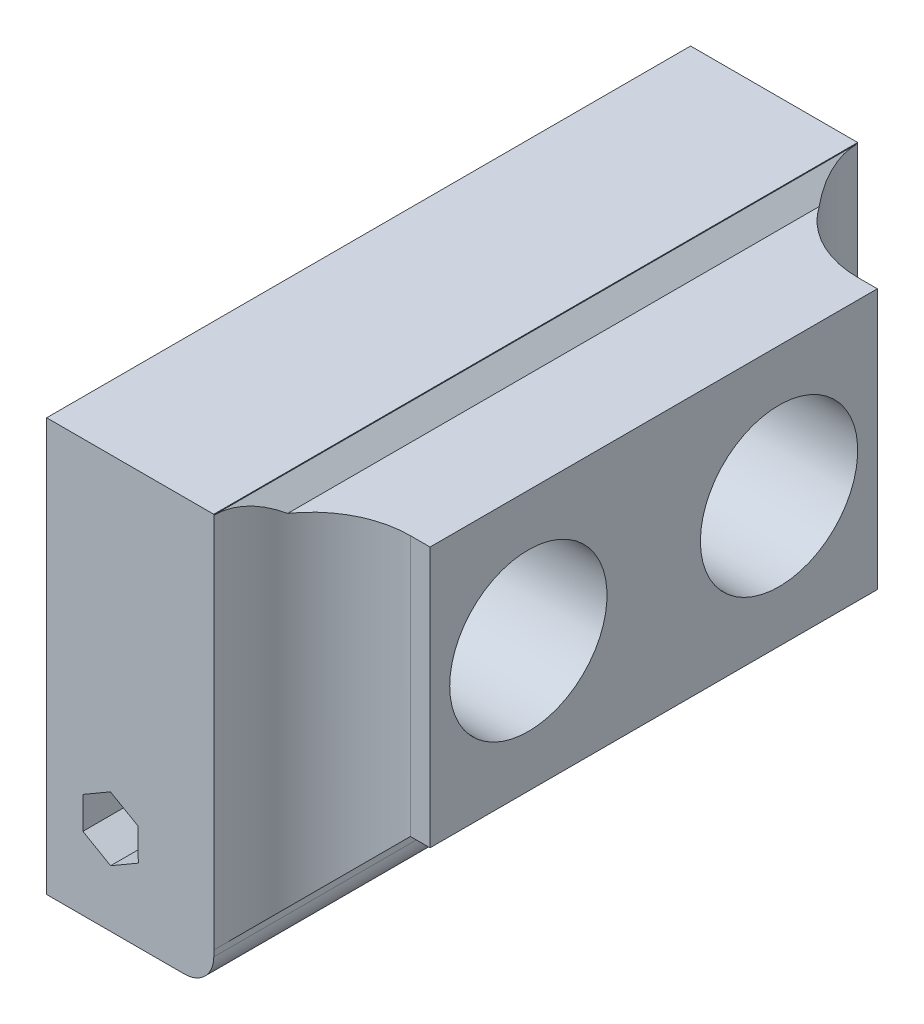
ISO-10303-21;
HEADER;
FILE_DESCRIPTION(('STEP AP214'),'2;1');
FILE_NAME('part.step','',(''),(''),'','','');
FILE_SCHEMA(('AUTOMOTIVE_DESIGN { 1 0 10303 214 1 1 1 1 }'));
ENDSEC;
DATA;
#1=APPLICATION_CONTEXT('core data for automotive mechanical design processes');
#2=APPLICATION_PROTOCOL_DEFINITION('international standard','automotive_design',2000,#1);
#3=PRODUCT_CONTEXT('',#1,'mechanical');
#4=PRODUCT('Part','Part','',(#3));
#5=PRODUCT_RELATED_PRODUCT_CATEGORY('part','',(#4));
#6=PRODUCT_DEFINITION_FORMATION('','',#4);
#7=PRODUCT_DEFINITION_CONTEXT('part definition',#1,'design');
#8=PRODUCT_DEFINITION('design','',#6,#7);
#9=PRODUCT_DEFINITION_SHAPE('','',#8);
#10=(LENGTH_UNIT() NAMED_UNIT(*) SI_UNIT(.MILLI.,.METRE.));
#11=(NAMED_UNIT(*) PLANE_ANGLE_UNIT() SI_UNIT($,.RADIAN.));
#12=(NAMED_UNIT(*) SI_UNIT($,.STERADIAN.) SOLID_ANGLE_UNIT());
#13=UNCERTAINTY_MEASURE_WITH_UNIT(LENGTH_MEASURE(1.E-05),#10,'distance_accuracy_value','');
#14=(GEOMETRIC_REPRESENTATION_CONTEXT(3) GLOBAL_UNCERTAINTY_ASSIGNED_CONTEXT((#13)) GLOBAL_UNIT_ASSIGNED_CONTEXT((#10,
#11,#12)) REPRESENTATION_CONTEXT('',''));
#15=CARTESIAN_POINT('',(0.,0.,0.));
#16=DIRECTION('',(0.,0.,1.));
#17=DIRECTION('',(1.,0.,0.));
#18=AXIS2_PLACEMENT_3D('',#15,#16,#17);
#19=CARTESIAN_POINT('',(-8.5,-7.57140846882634,-109.25));
#20=DIRECTION('',(0.,0.,1.));
#21=DIRECTION('',(1.,0.,0.));
#22=AXIS2_PLACEMENT_3D('',#19,#20,#21);
#23=CYLINDRICAL_SURFACE('',#22,1.75);
#24=CARTESIAN_POINT('',(-8.5,-7.57140846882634,1.25));
#25=DIRECTION('',(0.,0.,-1.));
#26=DIRECTION('',(-1.,0.,0.));
#27=AXIS2_PLACEMENT_3D('',#24,#25,#26);
#28=CIRCLE('',#27,1.75);
#29=CARTESIAN_POINT('',(-10.25,-7.57140846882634,1.25));
#30=VERTEX_POINT('',#29);
#31=EDGE_CURVE('E496',#30,#30,#28,.T.);
#32=ORIENTED_EDGE('',*,*,#31,.T.);
#33=EDGE_LOOP('',(#32));
#34=FACE_BOUND('',#33,.T.);
#35=CARTESIAN_POINT('',(-8.5,-7.57140846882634,5.));
#36=DIRECTION('',(0.,0.,1.));
#37=DIRECTION('',(1.,0.,0.));
#38=AXIS2_PLACEMENT_3D('',#35,#36,#37);
#39=CIRCLE('',#38,1.75);
#40=CARTESIAN_POINT('',(-6.75,-7.57140846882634,5.));
#41=VERTEX_POINT('',#40);
#42=EDGE_CURVE('E50',#41,#41,#39,.F.);
#43=ORIENTED_EDGE('',*,*,#42,.F.);
#44=EDGE_LOOP('',(#43));
#45=FACE_BOUND('',#44,.T.);
#46=ADVANCED_FACE('F46',(#34,#45),#23,.F.);
#47=CARTESIAN_POINT('',(-8.5,-7.57140846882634,-46.75));
#48=DIRECTION('',(0.,0.,-1.));
#49=DIRECTION('',(-1.,0.,0.));
#50=AXIS2_PLACEMENT_3D('',#47,#48,#49);
#51=CIRCLE('',#50,1.75);
#52=CARTESIAN_POINT('',(-10.25,-7.57140846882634,-46.75));
#53=VERTEX_POINT('',#52);
#54=EDGE_CURVE('E491',#53,#53,#51,.T.);
#55=ORIENTED_EDGE('',*,*,#54,.F.);
#56=EDGE_LOOP('',(#55));
#57=FACE_BOUND('',#56,.T.);
#58=CARTESIAN_POINT('',(-8.5,-7.57140846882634,-50.5));
#59=DIRECTION('',(0.,0.,-1.));
#60=DIRECTION('',(-1.,0.,0.));
#61=AXIS2_PLACEMENT_3D('',#58,#59,#60);
#62=CIRCLE('',#61,1.75);
#63=CARTESIAN_POINT('',(-10.25,-7.57140846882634,-50.5));
#64=VERTEX_POINT('',#63);
#65=EDGE_CURVE('E476',#64,#64,#62,.F.);
#66=ORIENTED_EDGE('',*,*,#65,.F.);
#67=EDGE_LOOP('',(#66));
#68=FACE_BOUND('',#67,.T.);
#69=ADVANCED_FACE('F909',(#57,#68),#23,.F.);
#70=CARTESIAN_POINT('',(0.,0.,0.));
#71=DIRECTION('',(1.,0.,0.));
#72=DIRECTION('',(0.,0.,-1.));
#73=AXIS2_PLACEMENT_3D('',#70,#71,#72);
#74=PLANE('',#73);
#75=DIRECTION('',(0.,1.,0.));
#76=VECTOR('',#75,1.);
#77=CARTESIAN_POINT('',(0.,0.,-17.25));
#78=LINE('',#77,#76);
#79=CARTESIAN_POINT('',(0.,0.,-17.25));
#80=VERTEX_POINT('',#79);
#81=CARTESIAN_POINT('',(0.,5.,-17.25));
#82=VERTEX_POINT('',#81);
#83=EDGE_CURVE('E723',#80,#82,#78,.T.);
#84=ORIENTED_EDGE('',*,*,#83,.F.);
#85=DIRECTION('',(0.,0.,-1.));
#86=VECTOR('',#85,1.);
#87=CARTESIAN_POINT('',(0.,0.,-45.5));
#88=LINE('',#87,#86);
#89=CARTESIAN_POINT('',(0.,0.,-28.25));
#90=VERTEX_POINT('',#89);
#91=EDGE_CURVE('E615',#80,#90,#88,.T.);
#92=ORIENTED_EDGE('',*,*,#91,.T.);
#93=DIRECTION('',(0.,1.,0.));
#94=VECTOR('',#93,1.);
#95=CARTESIAN_POINT('',(0.,0.,-28.25));
#96=LINE('',#95,#94);
#97=CARTESIAN_POINT('',(0.,5.,-28.25));
#98=VERTEX_POINT('',#97);
#99=EDGE_CURVE('E707',#90,#98,#96,.T.);
#100=ORIENTED_EDGE('',*,*,#99,.T.);
#101=DIRECTION('',(0.,0.,-1.));
#102=VECTOR('',#101,1.);
#103=CARTESIAN_POINT('',(0.,5.,0.));
#104=LINE('',#103,#102);
#105=EDGE_CURVE('E689',#82,#98,#104,.T.);
#106=ORIENTED_EDGE('',*,*,#105,.F.);
#107=EDGE_LOOP('',(#84,#92,#100,#106));
#108=FACE_BOUND('',#107,.T.);
#109=DIRECTION('',(0.,0.,-1.));
#110=VECTOR('',#109,1.);
#111=CARTESIAN_POINT('',(0.,20.5,0.));
#112=LINE('',#111,#110);
#113=CARTESIAN_POINT('',(0.,20.5,-17.25));
#114=VERTEX_POINT('',#113);
#115=CARTESIAN_POINT('',(0.,20.5,-28.25));
#116=VERTEX_POINT('',#115);
#117=EDGE_CURVE('E635',#114,#116,#112,.T.);
#118=ORIENTED_EDGE('',*,*,#117,.F.);
#119=DIRECTION('',(0.,-1.,0.));
#120=VECTOR('',#119,1.);
#121=CARTESIAN_POINT('',(0.,0.,-17.25));
#122=LINE('',#121,#120);
#123=CARTESIAN_POINT('',(0.,15.,-17.25));
#124=VERTEX_POINT('',#123);
#125=EDGE_CURVE('E719',#114,#124,#122,.T.);
#126=ORIENTED_EDGE('',*,*,#125,.T.);
#127=DIRECTION('',(0.,0.,-1.));
#128=VECTOR('',#127,1.);
#129=CARTESIAN_POINT('',(0.,15.,0.));
#130=LINE('',#129,#128);
#131=CARTESIAN_POINT('',(0.,15.,-28.25));
#132=VERTEX_POINT('',#131);
#133=EDGE_CURVE('E715',#124,#132,#130,.T.);
#134=ORIENTED_EDGE('',*,*,#133,.T.);
#135=DIRECTION('',(0.,-1.,0.));
#136=VECTOR('',#135,1.);
#137=CARTESIAN_POINT('',(0.,0.,-28.25));
#138=LINE('',#137,#136);
#139=EDGE_CURVE('E711',#116,#132,#138,.T.);
#140=ORIENTED_EDGE('',*,*,#139,.F.);
#141=EDGE_LOOP('',(#118,#126,#134,#140));
#142=FACE_BOUND('',#141,.T.);
#143=CARTESIAN_POINT('',(0.,10.25,-35.5));
#144=DIRECTION('',(1.,0.,0.));
#145=DIRECTION('',(0.,0.,-1.));
#146=AXIS2_PLACEMENT_3D('',#143,#144,#145);
#147=CIRCLE('',#146,8.);
#148=CARTESIAN_POINT('',(0.,10.25,-27.5));
#149=VERTEX_POINT('',#148);
#150=EDGE_CURVE('E683',#149,#149,#147,.T.);
#151=ORIENTED_EDGE('',*,*,#150,.T.);
#152=EDGE_LOOP('',(#151));
#153=FACE_BOUND('',#152,.T.);
#154=CARTESIAN_POINT('',(0.,10.25,-10.));
#155=DIRECTION('',(1.,0.,0.));
#156=DIRECTION('',(0.,0.,-1.));
#157=AXIS2_PLACEMENT_3D('',#154,#155,#156);
#158=CIRCLE('',#157,8.);
#159=CARTESIAN_POINT('',(0.,10.25,-2.));
#160=VERTEX_POINT('',#159);
#161=EDGE_CURVE('E703',#160,#160,#158,.T.);
#162=ORIENTED_EDGE('',*,*,#161,.T.);
#163=EDGE_LOOP('',(#162));
#164=FACE_BOUND('',#163,.T.);
#165=DIRECTION('',(0.,0.,1.));
#166=VECTOR('',#165,1.);
#167=CARTESIAN_POINT('',(0.,-1.82140846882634,1.25000000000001));
#168=LINE('',#167,#166);
#169=CARTESIAN_POINT('',(0.,-1.82140846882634,1.25000000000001));
#170=VERTEX_POINT('',#169);
#171=CARTESIAN_POINT('',(0.,-1.82140846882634,7.25000000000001));
#172=VERTEX_POINT('',#171);
#173=EDGE_CURVE('E512',#170,#172,#168,.T.);
#174=ORIENTED_EDGE('',*,*,#173,.T.);
#175=DIRECTION('',(0.,1.,0.));
#176=VECTOR('',#175,1.);
#177=CARTESIAN_POINT('',(0.,23.5,7.25000000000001));
#178=LINE('',#177,#176);
#179=CARTESIAN_POINT('',(0.,23.5,7.25000000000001));
#180=VERTEX_POINT('',#179);
#181=EDGE_CURVE('E568',#172,#180,#178,.T.);
#182=ORIENTED_EDGE('',*,*,#181,.T.);
#183=DIRECTION('',(0.,0.,-1.));
#184=VECTOR('',#183,1.);
#185=CARTESIAN_POINT('',(0.,23.5,-52.75));
#186=LINE('',#185,#184);
#187=CARTESIAN_POINT('',(0.,23.5,-52.75));
#188=VERTEX_POINT('',#187);
#189=EDGE_CURVE('E550',#180,#188,#186,.T.);
#190=ORIENTED_EDGE('',*,*,#189,.T.);
#191=DIRECTION('',(0.,-1.,0.));
#192=VECTOR('',#191,1.);
#193=CARTESIAN_POINT('',(0.,23.5,-52.75));
#194=LINE('',#193,#192);
#195=CARTESIAN_POINT('',(0.,-1.82140846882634,-52.75));
#196=VERTEX_POINT('',#195);
#197=EDGE_CURVE('E544',#188,#196,#194,.T.);
#198=ORIENTED_EDGE('',*,*,#197,.T.);
#199=DIRECTION('',(0.,0.,-1.));
#200=VECTOR('',#199,1.);
#201=CARTESIAN_POINT('',(0.,-1.82140846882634,-46.75));
#202=LINE('',#201,#200);
#203=CARTESIAN_POINT('',(0.,-1.82140846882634,-46.75));
#204=VERTEX_POINT('',#203);
#205=EDGE_CURVE('E541',#204,#196,#202,.T.);
#206=ORIENTED_EDGE('',*,*,#205,.F.);
#207=DIRECTION('',(0.,1.,0.));
#208=VECTOR('',#207,1.);
#209=CARTESIAN_POINT('',(0.,-1.82140846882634,-46.75));
#210=LINE('',#209,#208);
#211=CARTESIAN_POINT('',(0.,-14.8214084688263,-46.75));
#212=VERTEX_POINT('',#211);
#213=EDGE_CURVE('E522',#212,#204,#210,.T.);
#214=ORIENTED_EDGE('',*,*,#213,.F.);
#215=DIRECTION('',(0.,0.,1.));
#216=VECTOR('',#215,1.);
#217=CARTESIAN_POINT('',(0.,-14.8214084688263,-52.75));
#218=LINE('',#217,#216);
#219=CARTESIAN_POINT('',(0.,-14.8214084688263,1.25000000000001));
#220=VERTEX_POINT('',#219);
#221=EDGE_CURVE('E564',#212,#220,#218,.T.);
#222=ORIENTED_EDGE('',*,*,#221,.T.);
#223=DIRECTION('',(0.,-1.,0.));
#224=VECTOR('',#223,1.);
#225=CARTESIAN_POINT('',(0.,-1.82140846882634,1.25000000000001));
#226=LINE('',#225,#224);
#227=EDGE_CURVE('E500',#170,#220,#226,.T.);
#228=ORIENTED_EDGE('',*,*,#227,.F.);
#229=EDGE_LOOP('',(#174,#182,#190,#198,#206,#214,#222,#228));
#230=FACE_BOUND('',#229,.T.);
#231=ADVANCED_FACE('F911',(#108,#142,#153,#164,#230),#74,.F.);
#232=CARTESIAN_POINT('',(-15.,23.5,7.25000000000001));
#233=DIRECTION('',(0.,0.,-1.));
#234=DIRECTION('',(-1.,0.,0.));
#235=AXIS2_PLACEMENT_3D('',#232,#233,#234);
#236=PLANE('',#235);
#237=ORIENTED_EDGE('',*,*,#181,.F.);
#238=DIRECTION('',(1.,0.,0.));
#239=VECTOR('',#238,1.);
#240=CARTESIAN_POINT('',(0.,-1.82140846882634,7.25000000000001));
#241=LINE('',#240,#239);
#242=CARTESIAN_POINT('',(-15.,-1.82140846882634,7.25000000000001));
#243=VERTEX_POINT('',#242);
#244=EDGE_CURVE('E499',#243,#172,#241,.T.);
#245=ORIENTED_EDGE('',*,*,#244,.F.);
#246=DIRECTION('',(0.,1.,0.));
#247=VECTOR('',#246,1.);
#248=CARTESIAN_POINT('',(-15.,23.5,7.25000000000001));
#249=LINE('',#248,#247);
#250=CARTESIAN_POINT('',(-15.,23.5,7.25000000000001));
#251=VERTEX_POINT('',#250);
#252=EDGE_CURVE('E554',#243,#251,#249,.T.);
#253=ORIENTED_EDGE('',*,*,#252,.T.);
#254=DIRECTION('',(1.,0.,0.));
#255=VECTOR('',#254,1.);
#256=CARTESIAN_POINT('',(-15.,23.5,7.25000000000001));
#257=LINE('',#256,#255);
#258=EDGE_CURVE('E576',#251,#180,#257,.T.);
#259=ORIENTED_EDGE('',*,*,#258,.T.);
#260=EDGE_LOOP('',(#237,#245,#253,#259));
#261=FACE_BOUND('',#260,.T.);
#262=ADVANCED_FACE('F919',(#261),#236,.T.);
#263=CARTESIAN_POINT('',(-15.,23.5,-52.75));
#264=DIRECTION('',(0.,0.,1.));
#265=DIRECTION('',(1.,0.,0.));
#266=AXIS2_PLACEMENT_3D('',#263,#264,#265);
#267=PLANE('',#266);
#268=DIRECTION('',(0.,-1.,0.));
#269=VECTOR('',#268,1.);
#270=CARTESIAN_POINT('',(-15.,23.5,-52.75));
#271=LINE('',#270,#269);
#272=CARTESIAN_POINT('',(-15.,23.5,-52.75));
#273=VERTEX_POINT('',#272);
#274=CARTESIAN_POINT('',(-15.,-1.82140846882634,-52.75));
#275=VERTEX_POINT('',#274);
#276=EDGE_CURVE('E545',#273,#275,#271,.T.);
#277=ORIENTED_EDGE('',*,*,#276,.T.);
#278=DIRECTION('',(-1.,0.,0.));
#279=VECTOR('',#278,1.);
#280=CARTESIAN_POINT('',(0.,-1.82140846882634,-52.75));
#281=LINE('',#280,#279);
#282=EDGE_CURVE('E521',#196,#275,#281,.T.);
#283=ORIENTED_EDGE('',*,*,#282,.F.);
#284=ORIENTED_EDGE('',*,*,#197,.F.);
#285=DIRECTION('',(1.,0.,0.));
#286=VECTOR('',#285,1.);
#287=CARTESIAN_POINT('',(-15.,23.5,-52.75));
#288=LINE('',#287,#286);
#289=EDGE_CURVE('E560',#273,#188,#288,.T.);
#290=ORIENTED_EDGE('',*,*,#289,.F.);
#291=EDGE_LOOP('',(#277,#283,#284,#290));
#292=FACE_BOUND('',#291,.T.);
#293=ADVANCED_FACE('F955',(#292),#267,.T.);
#294=CARTESIAN_POINT('',(-15.,-14.8214084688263,-52.75));
#295=DIRECTION('',(0.,1.,0.));
#296=DIRECTION('',(0.,0.,1.));
#297=AXIS2_PLACEMENT_3D('',#294,#295,#296);
#298=PLANE('',#297);
#299=DIRECTION('',(0.,0.,-1.));
#300=VECTOR('',#299,1.);
#301=CARTESIAN_POINT('',(-6.75172362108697,-14.8214084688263,-17.75));
#302=LINE('',#301,#300);
#303=CARTESIAN_POINT('',(-6.75172362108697,-14.8214084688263,-28.75));
#304=VERTEX_POINT('',#303);
#305=CARTESIAN_POINT('',(-6.75172362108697,-14.8214084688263,-16.75));
#306=VERTEX_POINT('',#305);
#307=EDGE_CURVE('E803',#304,#306,#302,.F.);
#308=ORIENTED_EDGE('',*,*,#307,.T.);
#309=DIRECTION('',(1.,0.,0.));
#310=VECTOR('',#309,1.);
#311=CARTESIAN_POINT('',(-11.7299664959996,-14.8214084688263,-16.75));
#312=LINE('',#311,#310);
#313=CARTESIAN_POINT('',(-11.7299664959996,-14.8214084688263,-16.75));
#314=VERTEX_POINT('',#313);
#315=EDGE_CURVE('E859',#306,#314,#312,.F.);
#316=ORIENTED_EDGE('',*,*,#315,.T.);
#317=DIRECTION('',(0.,0.,1.));
#318=VECTOR('',#317,1.);
#319=CARTESIAN_POINT('',(-11.7299664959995,-14.8214084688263,-52.75));
#320=LINE('',#319,#318);
#321=CARTESIAN_POINT('',(-11.7299664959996,-14.8214084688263,-28.75));
#322=VERTEX_POINT('',#321);
#323=EDGE_CURVE('E495',#322,#314,#320,.T.);
#324=ORIENTED_EDGE('',*,*,#323,.F.);
#325=DIRECTION('',(-1.,0.,0.));
#326=VECTOR('',#325,1.);
#327=CARTESIAN_POINT('',(-6.75172362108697,-14.8214084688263,-28.75));
#328=LINE('',#327,#326);
#329=EDGE_CURVE('E809',#322,#304,#328,.F.);
#330=ORIENTED_EDGE('',*,*,#329,.T.);
#331=EDGE_LOOP('',(#308,#316,#324,#330));
#332=FACE_BOUND('',#331,.T.);
#333=DIRECTION('',(-1.,0.,0.));
#334=VECTOR('',#333,1.);
#335=CARTESIAN_POINT('',(0.,-14.8214084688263,1.25000000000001));
#336=LINE('',#335,#334);
#337=CARTESIAN_POINT('',(-15.,-14.8214084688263,1.25000000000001));
#338=VERTEX_POINT('',#337);
#339=EDGE_CURVE('E503',#220,#338,#336,.T.);
#340=ORIENTED_EDGE('',*,*,#339,.F.);
#341=ORIENTED_EDGE('',*,*,#221,.F.);
#342=DIRECTION('',(1.,0.,0.));
#343=VECTOR('',#342,1.);
#344=CARTESIAN_POINT('',(0.,-14.8214084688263,-46.75));
#345=LINE('',#344,#343);
#346=CARTESIAN_POINT('',(-15.,-14.8214084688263,-46.75));
#347=VERTEX_POINT('',#346);
#348=EDGE_CURVE('E532',#347,#212,#345,.T.);
#349=ORIENTED_EDGE('',*,*,#348,.F.);
#350=DIRECTION('',(0.,0.,1.));
#351=VECTOR('',#350,1.);
#352=CARTESIAN_POINT('',(-15.,-14.8214084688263,-52.75));
#353=LINE('',#352,#351);
#354=EDGE_CURVE('E549',#347,#338,#353,.T.);
#355=ORIENTED_EDGE('',*,*,#354,.T.);
#356=EDGE_LOOP('',(#340,#341,#349,#355));
#357=FACE_BOUND('',#356,.T.);
#358=ADVANCED_FACE('F957',(#332,#357),#298,.T.);
#359=CARTESIAN_POINT('',(2.,0.,0.));
#360=DIRECTION('',(-1.,0.,0.));
#361=DIRECTION('',(0.,0.,1.));
#362=AXIS2_PLACEMENT_3D('',#359,#360,#361);
#363=PLANE('',#362);
#364=DIRECTION('',(0.,1.,0.));
#365=VECTOR('',#364,1.);
#366=CARTESIAN_POINT('',(2.,25.3860544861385,10.));
#367=LINE('',#366,#365);
#368=CARTESIAN_POINT('',(2.,25.3,10.));
#369=VERTEX_POINT('',#368);
#370=CARTESIAN_POINT('',(2.,25.3860544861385,10.));
#371=VERTEX_POINT('',#370);
#372=EDGE_CURVE('E601',#369,#371,#367,.T.);
#373=ORIENTED_EDGE('',*,*,#372,.F.);
#374=DIRECTION('',(0.,0.,-1.));
#375=VECTOR('',#374,1.);
#376=CARTESIAN_POINT('',(2.,25.3,0.));
#377=LINE('',#376,#375);
#378=CARTESIAN_POINT('',(2.,25.3,-55.5));
#379=VERTEX_POINT('',#378);
#380=EDGE_CURVE('E783',#369,#379,#377,.T.);
#381=ORIENTED_EDGE('',*,*,#380,.T.);
#382=DIRECTION('',(0.,-1.,0.));
#383=VECTOR('',#382,1.);
#384=CARTESIAN_POINT('',(2.,25.3860544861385,-55.5));
#385=LINE('',#384,#383);
#386=CARTESIAN_POINT('',(2.,25.3860544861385,-55.5));
#387=VERTEX_POINT('',#386);
#388=EDGE_CURVE('E597',#387,#379,#385,.T.);
#389=ORIENTED_EDGE('',*,*,#388,.F.);
#390=DIRECTION('',(0.,0.,-1.));
#391=VECTOR('',#390,1.);
#392=CARTESIAN_POINT('',(2.,25.3860544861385,-55.5));
#393=LINE('',#392,#391);
#394=EDGE_CURVE('E606',#371,#387,#393,.T.);
#395=ORIENTED_EDGE('',*,*,#394,.F.);
#396=EDGE_LOOP('',(#373,#381,#389,#395));
#397=FACE_BOUND('',#396,.T.);
#398=ADVANCED_FACE('F960',(#397),#363,.F.);
#399=CARTESIAN_POINT('',(14.,0.,-45.5));
#400=DIRECTION('',(0.,0.,1.));
#401=DIRECTION('',(1.,0.,0.));
#402=AXIS2_PLACEMENT_3D('',#399,#400,#401);
#403=PLANE('',#402);
#404=DIRECTION('',(1.,0.,0.));
#405=VECTOR('',#404,1.);
#406=CARTESIAN_POINT('',(0.,-3.,-45.5));
#407=LINE('',#406,#405);
#408=CARTESIAN_POINT('',(11.9999999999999,-3.,-45.5));
#409=VERTEX_POINT('',#408);
#410=CARTESIAN_POINT('',(14.,-3.,-45.5));
#411=VERTEX_POINT('',#410);
#412=EDGE_CURVE('E624',#409,#411,#407,.T.);
#413=ORIENTED_EDGE('',*,*,#412,.F.);
#414=DIRECTION('',(0.,-1.,0.));
#415=VECTOR('',#414,1.);
#416=CARTESIAN_POINT('',(12.,23.5,-45.5));
#417=LINE('',#416,#415);
#418=CARTESIAN_POINT('',(12.,23.5,-45.5));
#419=VERTEX_POINT('',#418);
#420=EDGE_CURVE('E763',#409,#419,#417,.F.);
#421=ORIENTED_EDGE('',*,*,#420,.T.);
#422=DIRECTION('',(-1.,0.,0.));
#423=VECTOR('',#422,1.);
#424=CARTESIAN_POINT('',(14.,23.5,-45.5));
#425=LINE('',#424,#423);
#426=CARTESIAN_POINT('',(14.,23.5,-45.5));
#427=VERTEX_POINT('',#426);
#428=EDGE_CURVE('E650',#427,#419,#425,.T.);
#429=ORIENTED_EDGE('',*,*,#428,.F.);
#430=DIRECTION('',(0.,1.,0.));
#431=VECTOR('',#430,1.);
#432=CARTESIAN_POINT('',(14.,0.,-45.5));
#433=LINE('',#432,#431);
#434=EDGE_CURVE('E693',#411,#427,#433,.T.);
#435=ORIENTED_EDGE('',*,*,#434,.F.);
#436=EDGE_LOOP('',(#413,#421,#429,#435));
#437=FACE_BOUND('',#436,.T.);
#438=ADVANCED_FACE('F1029',(#437),#403,.F.);
#439=CARTESIAN_POINT('',(14.,0.,0.));
#440=DIRECTION('',(0.,0.,1.));
#441=DIRECTION('',(1.,0.,0.));
#442=AXIS2_PLACEMENT_3D('',#439,#440,#441);
#443=PLANE('',#442);
#444=DIRECTION('',(-1.,0.,0.));
#445=VECTOR('',#444,1.);
#446=CARTESIAN_POINT('',(14.,23.5,0.));
#447=LINE('',#446,#445);
#448=CARTESIAN_POINT('',(14.,23.5,0.));
#449=VERTEX_POINT('',#448);
#450=CARTESIAN_POINT('',(12.,23.5,0.));
#451=VERTEX_POINT('',#450);
#452=EDGE_CURVE('E643',#449,#451,#447,.T.);
#453=ORIENTED_EDGE('',*,*,#452,.T.);
#454=DIRECTION('',(0.,1.,0.));
#455=VECTOR('',#454,1.);
#456=CARTESIAN_POINT('',(12.,0.,0.));
#457=LINE('',#456,#455);
#458=CARTESIAN_POINT('',(11.9999999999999,-3.,0.));
#459=VERTEX_POINT('',#458);
#460=EDGE_CURVE('E773',#451,#459,#457,.F.);
#461=ORIENTED_EDGE('',*,*,#460,.T.);
#462=DIRECTION('',(-1.,0.,0.));
#463=VECTOR('',#462,1.);
#464=CARTESIAN_POINT('',(0.,-3.,0.));
#465=LINE('',#464,#463);
#466=CARTESIAN_POINT('',(14.,-3.,0.));
#467=VERTEX_POINT('',#466);
#468=EDGE_CURVE('E631',#467,#459,#465,.T.);
#469=ORIENTED_EDGE('',*,*,#468,.F.);
#470=DIRECTION('',(0.,1.,0.));
#471=VECTOR('',#470,1.);
#472=CARTESIAN_POINT('',(14.,0.,0.));
#473=LINE('',#472,#471);
#474=EDGE_CURVE('E696',#467,#449,#473,.T.);
#475=ORIENTED_EDGE('',*,*,#474,.T.);
#476=EDGE_LOOP('',(#453,#461,#469,#475));
#477=FACE_BOUND('',#476,.T.);
#478=ADVANCED_FACE('F1000',(#477),#443,.T.);
#479=CARTESIAN_POINT('',(14.,23.5,0.));
#480=DIRECTION('',(0.,1.,0.));
#481=DIRECTION('',(0.,0.,1.));
#482=AXIS2_PLACEMENT_3D('',#479,#480,#481);
#483=PLANE('',#482);
#484=CARTESIAN_POINT('',(12.,23.5,-55.5));
#485=DIRECTION('',(0.,1.,0.));
#486=DIRECTION('',(0.,0.,1.));
#487=AXIS2_PLACEMENT_3D('',#484,#485,#486);
#488=CIRCLE('',#487,10.);
#489=CARTESIAN_POINT('',(3.79999999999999,23.5,-49.7763647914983));
#490=VERTEX_POINT('',#489);
#491=EDGE_CURVE('E769',#419,#490,#488,.F.);
#492=ORIENTED_EDGE('',*,*,#491,.T.);
#493=DIRECTION('',(0.,0.,1.));
#494=VECTOR('',#493,1.);
#495=CARTESIAN_POINT('',(3.8,23.5,0.));
#496=LINE('',#495,#494);
#497=CARTESIAN_POINT('',(3.79999999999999,23.5,4.27636479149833));
#498=VERTEX_POINT('',#497);
#499=EDGE_CURVE('E787',#490,#498,#496,.T.);
#500=ORIENTED_EDGE('',*,*,#499,.T.);
#501=CARTESIAN_POINT('',(12.,23.5,10.));
#502=DIRECTION('',(0.,1.,0.));
#503=DIRECTION('',(0.,0.,1.));
#504=AXIS2_PLACEMENT_3D('',#501,#502,#503);
#505=CIRCLE('',#504,10.);
#506=EDGE_CURVE('E776',#498,#451,#505,.F.);
#507=ORIENTED_EDGE('',*,*,#506,.T.);
#508=ORIENTED_EDGE('',*,*,#452,.F.);
#509=DIRECTION('',(0.,0.,-1.));
#510=VECTOR('',#509,1.);
#511=CARTESIAN_POINT('',(14.,23.5,0.));
#512=LINE('',#511,#510);
#513=EDGE_CURVE('E639',#449,#427,#512,.T.);
#514=ORIENTED_EDGE('',*,*,#513,.T.);
#515=ORIENTED_EDGE('',*,*,#428,.T.);
#516=EDGE_LOOP('',(#492,#500,#507,#508,#514,#515));
#517=FACE_BOUND('',#516,.T.);
#518=ADVANCED_FACE('F992',(#517),#483,.T.);
#519=CARTESIAN_POINT('',(0.,-3.,0.));
#520=DIRECTION('',(0.,1.,0.));
#521=DIRECTION('',(0.,0.,1.));
#522=AXIS2_PLACEMENT_3D('',#519,#520,#521);
#523=PLANE('',#522);
#524=ORIENTED_EDGE('',*,*,#468,.T.);
#525=DIRECTION('',(0.,0.,-1.));
#526=VECTOR('',#525,1.);
#527=CARTESIAN_POINT('',(12.,-3.,-45.5));
#528=LINE('',#527,#526);
#529=EDGE_CURVE('E759',#459,#409,#528,.T.);
#530=ORIENTED_EDGE('',*,*,#529,.T.);
#531=ORIENTED_EDGE('',*,*,#412,.T.);
#532=DIRECTION('',(0.,0.,1.));
#533=VECTOR('',#532,1.);
#534=CARTESIAN_POINT('',(14.,-3.,-45.5));
#535=LINE('',#534,#533);
#536=EDGE_CURVE('E627',#411,#467,#535,.T.);
#537=ORIENTED_EDGE('',*,*,#536,.T.);
#538=EDGE_LOOP('',(#524,#530,#531,#537));
#539=FACE_BOUND('',#538,.T.);
#540=ADVANCED_FACE('F988',(#539),#523,.F.);
#541=CARTESIAN_POINT('',(14.,0.,-28.25));
#542=DIRECTION('',(0.,0.,1.));
#543=DIRECTION('',(1.,0.,0.));
#544=AXIS2_PLACEMENT_3D('',#541,#542,#543);
#545=PLANE('',#544);
#546=DIRECTION('',(-1.,0.,0.));
#547=VECTOR('',#546,1.);
#548=CARTESIAN_POINT('',(14.,0.,-28.25));
#549=LINE('',#548,#547);
#550=CARTESIAN_POINT('',(7.,0.,-28.25));
#551=VERTEX_POINT('',#550);
#552=EDGE_CURVE('E751',#551,#90,#549,.T.);
#553=ORIENTED_EDGE('',*,*,#552,.F.);
#554=DIRECTION('',(0.,1.,0.));
#555=VECTOR('',#554,1.);
#556=CARTESIAN_POINT('',(7.,0.,-28.25));
#557=LINE('',#556,#555);
#558=CARTESIAN_POINT('',(7.,5.,-28.25));
#559=VERTEX_POINT('',#558);
#560=EDGE_CURVE('E664',#551,#559,#557,.T.);
#561=ORIENTED_EDGE('',*,*,#560,.T.);
#562=DIRECTION('',(-1.,0.,0.));
#563=VECTOR('',#562,1.);
#564=CARTESIAN_POINT('',(14.,5.,-28.25));
#565=LINE('',#564,#563);
#566=EDGE_CURVE('E699',#559,#98,#565,.T.);
#567=ORIENTED_EDGE('',*,*,#566,.T.);
#568=ORIENTED_EDGE('',*,*,#99,.F.);
#569=EDGE_LOOP('',(#553,#561,#567,#568));
#570=FACE_BOUND('',#569,.T.);
#571=ADVANCED_FACE('F991',(#570),#545,.T.);
#572=CARTESIAN_POINT('',(14.,0.,-17.25));
#573=DIRECTION('',(0.,0.,1.));
#574=DIRECTION('',(1.,0.,0.));
#575=AXIS2_PLACEMENT_3D('',#572,#573,#574);
#576=PLANE('',#575);
#577=DIRECTION('',(0.,1.,0.));
#578=VECTOR('',#577,1.);
#579=CARTESIAN_POINT('',(7.,0.,-17.25));
#580=LINE('',#579,#578);
#581=CARTESIAN_POINT('',(7.,0.,-17.25));
#582=VERTEX_POINT('',#581);
#583=CARTESIAN_POINT('',(7.,5.,-17.25));
#584=VERTEX_POINT('',#583);
#585=EDGE_CURVE('E659',#582,#584,#580,.T.);
#586=ORIENTED_EDGE('',*,*,#585,.F.);
#587=DIRECTION('',(-1.,0.,0.));
#588=VECTOR('',#587,1.);
#589=CARTESIAN_POINT('',(14.,0.,-17.25));
#590=LINE('',#589,#588);
#591=EDGE_CURVE('E735',#582,#80,#590,.T.);
#592=ORIENTED_EDGE('',*,*,#591,.T.);
#593=ORIENTED_EDGE('',*,*,#83,.T.);
#594=DIRECTION('',(-1.,0.,0.));
#595=VECTOR('',#594,1.);
#596=CARTESIAN_POINT('',(14.,5.,-17.25));
#597=LINE('',#596,#595);
#598=EDGE_CURVE('E732',#584,#82,#597,.T.);
#599=ORIENTED_EDGE('',*,*,#598,.F.);
#600=EDGE_LOOP('',(#586,#592,#593,#599));
#601=FACE_BOUND('',#600,.T.);
#602=ADVANCED_FACE('F1022',(#601),#576,.F.);
#603=CARTESIAN_POINT('',(14.,5.,0.));
#604=DIRECTION('',(0.,1.,0.));
#605=DIRECTION('',(0.,0.,1.));
#606=AXIS2_PLACEMENT_3D('',#603,#604,#605);
#607=PLANE('',#606);
#608=DIRECTION('',(0.,0.,-1.));
#609=VECTOR('',#608,1.);
#610=CARTESIAN_POINT('',(7.,5.,-17.25));
#611=LINE('',#610,#609);
#612=EDGE_CURVE('E654',#584,#559,#611,.T.);
#613=ORIENTED_EDGE('',*,*,#612,.F.);
#614=ORIENTED_EDGE('',*,*,#598,.T.);
#615=ORIENTED_EDGE('',*,*,#105,.T.);
#616=ORIENTED_EDGE('',*,*,#566,.F.);
#617=EDGE_LOOP('',(#613,#614,#615,#616));
#618=FACE_BOUND('',#617,.T.);
#619=ADVANCED_FACE('F1018',(#618),#607,.F.);
#620=CARTESIAN_POINT('',(14.,0.,-28.25));
#621=DIRECTION('',(0.,0.,-1.));
#622=DIRECTION('',(0.,1.,0.));
#623=AXIS2_PLACEMENT_3D('',#620,#621,#622);
#624=PLANE('',#623);
#625=DIRECTION('',(0.,-1.,0.));
#626=VECTOR('',#625,1.);
#627=CARTESIAN_POINT('',(6.,20.5,-28.25));
#628=LINE('',#627,#626);
#629=CARTESIAN_POINT('',(6.,20.5,-28.25));
#630=VERTEX_POINT('',#629);
#631=CARTESIAN_POINT('',(6.,15.,-28.25));
#632=VERTEX_POINT('',#631);
#633=EDGE_CURVE('E679',#630,#632,#628,.T.);
#634=ORIENTED_EDGE('',*,*,#633,.F.);
#635=DIRECTION('',(-1.,0.,0.));
#636=VECTOR('',#635,1.);
#637=CARTESIAN_POINT('',(14.,20.5,-28.25));
#638=LINE('',#637,#636);
#639=EDGE_CURVE('E748',#630,#116,#638,.T.);
#640=ORIENTED_EDGE('',*,*,#639,.T.);
#641=ORIENTED_EDGE('',*,*,#139,.T.);
#642=DIRECTION('',(-1.,0.,0.));
#643=VECTOR('',#642,1.);
#644=CARTESIAN_POINT('',(14.,15.,-28.25));
#645=LINE('',#644,#643);
#646=EDGE_CURVE('E745',#632,#132,#645,.T.);
#647=ORIENTED_EDGE('',*,*,#646,.F.);
#648=EDGE_LOOP('',(#634,#640,#641,#647));
#649=FACE_BOUND('',#648,.T.);
#650=ADVANCED_FACE('F1021',(#649),#624,.F.);
#651=CARTESIAN_POINT('',(14.,15.,0.));
#652=DIRECTION('',(0.,1.,0.));
#653=DIRECTION('',(0.,0.,1.));
#654=AXIS2_PLACEMENT_3D('',#651,#652,#653);
#655=PLANE('',#654);
#656=DIRECTION('',(-1.,0.,0.));
#657=VECTOR('',#656,1.);
#658=CARTESIAN_POINT('',(14.,15.,-17.25));
#659=LINE('',#658,#657);
#660=CARTESIAN_POINT('',(6.,15.,-17.25));
#661=VERTEX_POINT('',#660);
#662=EDGE_CURVE('E742',#661,#124,#659,.T.);
#663=ORIENTED_EDGE('',*,*,#662,.F.);
#664=DIRECTION('',(0.,0.,1.));
#665=VECTOR('',#664,1.);
#666=CARTESIAN_POINT('',(6.,15.,-17.25));
#667=LINE('',#666,#665);
#668=EDGE_CURVE('E668',#632,#661,#667,.T.);
#669=ORIENTED_EDGE('',*,*,#668,.F.);
#670=ORIENTED_EDGE('',*,*,#646,.T.);
#671=ORIENTED_EDGE('',*,*,#133,.F.);
#672=EDGE_LOOP('',(#663,#669,#670,#671));
#673=FACE_BOUND('',#672,.T.);
#674=ADVANCED_FACE('F1035',(#673),#655,.T.);
#675=CARTESIAN_POINT('',(14.,0.,-17.25));
#676=DIRECTION('',(0.,0.,-1.));
#677=DIRECTION('',(-1.,0.,0.));
#678=AXIS2_PLACEMENT_3D('',#675,#676,#677);
#679=PLANE('',#678);
#680=DIRECTION('',(-1.,0.,0.));
#681=VECTOR('',#680,1.);
#682=CARTESIAN_POINT('',(14.,20.5,-17.25));
#683=LINE('',#682,#681);
#684=CARTESIAN_POINT('',(6.,20.5,-17.25));
#685=VERTEX_POINT('',#684);
#686=EDGE_CURVE('E738',#685,#114,#683,.T.);
#687=ORIENTED_EDGE('',*,*,#686,.F.);
#688=DIRECTION('',(0.,-1.,0.));
#689=VECTOR('',#688,1.);
#690=CARTESIAN_POINT('',(6.,20.5,-17.25));
#691=LINE('',#690,#689);
#692=EDGE_CURVE('E673',#685,#661,#691,.T.);
#693=ORIENTED_EDGE('',*,*,#692,.T.);
#694=ORIENTED_EDGE('',*,*,#662,.T.);
#695=ORIENTED_EDGE('',*,*,#125,.F.);
#696=EDGE_LOOP('',(#687,#693,#694,#695));
#697=FACE_BOUND('',#696,.T.);
#698=ADVANCED_FACE('F1031',(#697),#679,.T.);
#699=CARTESIAN_POINT('',(14.,10.25,-10.));
#700=DIRECTION('',(-1.,0.,0.));
#701=DIRECTION('',(0.,0.,1.));
#702=AXIS2_PLACEMENT_3D('',#699,#700,#701);
#703=CYLINDRICAL_SURFACE('',#702,8.);
#704=CARTESIAN_POINT('',(14.,10.25,-10.));
#705=DIRECTION('',(1.,0.,0.));
#706=DIRECTION('',(0.,0.,-1.));
#707=AXIS2_PLACEMENT_3D('',#704,#705,#706);
#708=CIRCLE('',#707,8.);
#709=CARTESIAN_POINT('',(14.,10.25,-2.));
#710=VERTEX_POINT('',#709);
#711=EDGE_CURVE('E688',#710,#710,#708,.T.);
#712=CARTESIAN_POINT('',(14.,10.25,-2.));
#713=CARTESIAN_POINT('',(13.8541666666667,10.25,-2.));
#714=CARTESIAN_POINT('',(13.7083333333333,10.25,-2.));
#715=CARTESIAN_POINT('',(13.4166666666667,10.25,-2.));
#716=CARTESIAN_POINT('',(13.2708333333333,10.25,-2.));
#717=CARTESIAN_POINT('',(12.9791666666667,10.25,-2.));
#718=CARTESIAN_POINT('',(12.8333333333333,10.25,-2.));
#719=CARTESIAN_POINT('',(12.5416666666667,10.25,-2.));
#720=CARTESIAN_POINT('',(12.3958333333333,10.25,-2.));
#721=CARTESIAN_POINT('',(12.1041666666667,10.25,-2.));
#722=CARTESIAN_POINT('',(11.9583333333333,10.25,-2.));
#723=CARTESIAN_POINT('',(11.6666666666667,10.25,-2.));
#724=CARTESIAN_POINT('',(11.5208333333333,10.25,-2.));
#725=CARTESIAN_POINT('',(11.2291666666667,10.25,-2.));
#726=CARTESIAN_POINT('',(11.0833333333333,10.25,-2.));
#727=CARTESIAN_POINT('',(10.7916666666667,10.25,-2.));
#728=CARTESIAN_POINT('',(10.6458333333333,10.25,-2.));
#729=CARTESIAN_POINT('',(10.3541666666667,10.25,-2.));
#730=CARTESIAN_POINT('',(10.2083333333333,10.25,-2.));
#731=CARTESIAN_POINT('',(9.91666666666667,10.25,-2.));
#732=CARTESIAN_POINT('',(9.77083333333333,10.25,-2.));
#733=CARTESIAN_POINT('',(9.47916666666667,10.25,-2.));
#734=CARTESIAN_POINT('',(9.33333333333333,10.25,-2.));
#735=CARTESIAN_POINT('',(9.04166666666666,10.25,-2.));
#736=CARTESIAN_POINT('',(8.89583333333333,10.25,-2.));
#737=CARTESIAN_POINT('',(8.60416666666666,10.25,-2.));
#738=CARTESIAN_POINT('',(8.45833333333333,10.25,-2.));
#739=CARTESIAN_POINT('',(8.16666666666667,10.25,-2.));
#740=CARTESIAN_POINT('',(8.02083333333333,10.25,-2.));
#741=CARTESIAN_POINT('',(7.72916666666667,10.25,-2.));
#742=CARTESIAN_POINT('',(7.58333333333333,10.25,-2.));
#743=CARTESIAN_POINT('',(7.29166666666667,10.25,-2.));
#744=CARTESIAN_POINT('',(7.14583333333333,10.25,-2.));
#745=CARTESIAN_POINT('',(6.85416666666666,10.25,-2.));
#746=CARTESIAN_POINT('',(6.70833333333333,10.25,-2.));
#747=CARTESIAN_POINT('',(6.41666666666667,10.25,-2.));
#748=CARTESIAN_POINT('',(6.27083333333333,10.25,-2.));
#749=CARTESIAN_POINT('',(5.97916666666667,10.25,-2.));
#750=CARTESIAN_POINT('',(5.83333333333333,10.25,-2.));
#751=CARTESIAN_POINT('',(5.54166666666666,10.25,-2.));
#752=CARTESIAN_POINT('',(5.39583333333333,10.25,-2.));
#753=CARTESIAN_POINT('',(5.10416666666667,10.25,-2.));
#754=CARTESIAN_POINT('',(4.95833333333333,10.25,-2.));
#755=CARTESIAN_POINT('',(4.66666666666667,10.25,-2.));
#756=CARTESIAN_POINT('',(4.52083333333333,10.25,-2.));
#757=CARTESIAN_POINT('',(4.22916666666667,10.25,-2.));
#758=CARTESIAN_POINT('',(4.08333333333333,10.25,-2.));
#759=CARTESIAN_POINT('',(3.79166666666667,10.25,-2.));
#760=CARTESIAN_POINT('',(3.64583333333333,10.25,-2.));
#761=CARTESIAN_POINT('',(3.35416666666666,10.25,-2.));
#762=CARTESIAN_POINT('',(3.20833333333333,10.25,-2.));
#763=CARTESIAN_POINT('',(2.91666666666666,10.25,-2.));
#764=CARTESIAN_POINT('',(2.77083333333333,10.25,-2.));
#765=CARTESIAN_POINT('',(2.47916666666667,10.25,-2.));
#766=CARTESIAN_POINT('',(2.33333333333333,10.25,-2.));
#767=CARTESIAN_POINT('',(2.04166666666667,10.25,-2.));
#768=CARTESIAN_POINT('',(1.89583333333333,10.25,-2.));
#769=CARTESIAN_POINT('',(1.60416666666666,10.25,-2.));
#770=CARTESIAN_POINT('',(1.45833333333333,10.25,-2.));
#771=CARTESIAN_POINT('',(1.16666666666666,10.25,-2.));
#772=CARTESIAN_POINT('',(1.02083333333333,10.25,-2.));
#773=CARTESIAN_POINT('',(0.729166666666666,10.25,-2.));
#774=CARTESIAN_POINT('',(0.583333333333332,10.25,-2.));
#775=CARTESIAN_POINT('',(0.291666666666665,10.25,-2.));
#776=CARTESIAN_POINT('',(0.145833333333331,10.25,-2.));
#777=CARTESIAN_POINT('',(0.,10.25,-2.));
#778=B_SPLINE_CURVE_WITH_KNOTS('',3,(#712,#713,#714,#715,#716,#717,#718,#719,#720,#721,#722,
#723,#724,#725,#726,#727,#728,#729,#730,#731,#732,#733,#734,#735,#736,#737,#738,#739,#740,#741,
#742,#743,#744,#745,#746,#747,#748,#749,#750,#751,#752,#753,#754,#755,#756,#757,#758,#759,#760,
#761,#762,#763,#764,#765,#766,#767,#768,#769,#770,#771,#772,#773,#774,#775,#776,#777),
.UNSPECIFIED.,.F.,.F.,(4,2,2,2,2,2,2,2,2,2,2,2,2,2,2,2,2,2,2,2,2,2,2,2,2,2,2,2,2,2,2,2,4),(0.,
0.437499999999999,0.874999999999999,1.3125,1.75,2.1875,2.625,3.0625,3.5,3.9375,4.375,4.8125,
5.25,5.6875,6.125,6.5625,7.,7.4375,7.875,8.3125,8.75,9.1875,9.625,10.0625,10.5,10.9375,11.375,
11.8125,12.25,12.6875,13.125,13.5625,14.),.UNSPECIFIED.);
#779=EDGE_CURVE('BSEAM1034',#710,#160,#778,.T.);
#780=ORIENTED_EDGE('',*,*,#711,.T.);
#781=ORIENTED_EDGE('',*,*,#161,.F.);
#782=ORIENTED_EDGE('',*,*,#779,.T.);
#783=ORIENTED_EDGE('',*,*,#779,.F.);
#784=EDGE_LOOP('',(#780,#782,#781,#783));
#785=FACE_BOUND('',#784,.T.);
#786=ADVANCED_FACE('F1034',(#785),#703,.F.);
#787=CARTESIAN_POINT('',(14.,10.25,-35.5));
#788=DIRECTION('',(-1.,0.,0.));
#789=DIRECTION('',(0.,0.,1.));
#790=AXIS2_PLACEMENT_3D('',#787,#788,#789);
#791=CYLINDRICAL_SURFACE('',#790,8.);
#792=CARTESIAN_POINT('',(14.,10.25,-35.5));
#793=DIRECTION('',(1.,0.,0.));
#794=DIRECTION('',(0.,0.,-1.));
#795=AXIS2_PLACEMENT_3D('',#792,#793,#794);
#796=CIRCLE('',#795,8.);
#797=CARTESIAN_POINT('',(14.,10.25,-27.5));
#798=VERTEX_POINT('',#797);
#799=EDGE_CURVE('E684',#798,#798,#796,.T.);
#800=CARTESIAN_POINT('',(14.,10.25,-27.5));
#801=CARTESIAN_POINT('',(13.8541666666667,10.25,-27.5));
#802=CARTESIAN_POINT('',(13.7083333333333,10.25,-27.5));
#803=CARTESIAN_POINT('',(13.4166666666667,10.25,-27.5));
#804=CARTESIAN_POINT('',(13.2708333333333,10.25,-27.5));
#805=CARTESIAN_POINT('',(12.9791666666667,10.25,-27.5));
#806=CARTESIAN_POINT('',(12.8333333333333,10.25,-27.5));
#807=CARTESIAN_POINT('',(12.5416666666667,10.25,-27.5));
#808=CARTESIAN_POINT('',(12.3958333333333,10.25,-27.5));
#809=CARTESIAN_POINT('',(12.1041666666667,10.25,-27.5));
#810=CARTESIAN_POINT('',(11.9583333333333,10.25,-27.5));
#811=CARTESIAN_POINT('',(11.6666666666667,10.25,-27.5));
#812=CARTESIAN_POINT('',(11.5208333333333,10.25,-27.5));
#813=CARTESIAN_POINT('',(11.2291666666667,10.25,-27.5));
#814=CARTESIAN_POINT('',(11.0833333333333,10.25,-27.5));
#815=CARTESIAN_POINT('',(10.7916666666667,10.25,-27.5));
#816=CARTESIAN_POINT('',(10.6458333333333,10.25,-27.5));
#817=CARTESIAN_POINT('',(10.3541666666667,10.25,-27.5));
#818=CARTESIAN_POINT('',(10.2083333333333,10.25,-27.5));
#819=CARTESIAN_POINT('',(9.91666666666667,10.25,-27.5));
#820=CARTESIAN_POINT('',(9.77083333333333,10.25,-27.5));
#821=CARTESIAN_POINT('',(9.47916666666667,10.25,-27.5));
#822=CARTESIAN_POINT('',(9.33333333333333,10.25,-27.5));
#823=CARTESIAN_POINT('',(9.04166666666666,10.25,-27.5));
#824=CARTESIAN_POINT('',(8.89583333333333,10.25,-27.5));
#825=CARTESIAN_POINT('',(8.60416666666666,10.25,-27.5));
#826=CARTESIAN_POINT('',(8.45833333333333,10.25,-27.5));
#827=CARTESIAN_POINT('',(8.16666666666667,10.25,-27.5));
#828=CARTESIAN_POINT('',(8.02083333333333,10.25,-27.5));
#829=CARTESIAN_POINT('',(7.72916666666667,10.25,-27.5));
#830=CARTESIAN_POINT('',(7.58333333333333,10.25,-27.5));
#831=CARTESIAN_POINT('',(7.29166666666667,10.25,-27.5));
#832=CARTESIAN_POINT('',(7.14583333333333,10.25,-27.5));
#833=CARTESIAN_POINT('',(6.85416666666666,10.25,-27.5));
#834=CARTESIAN_POINT('',(6.70833333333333,10.25,-27.5));
#835=CARTESIAN_POINT('',(6.41666666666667,10.25,-27.5));
#836=CARTESIAN_POINT('',(6.27083333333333,10.25,-27.5));
#837=CARTESIAN_POINT('',(5.97916666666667,10.25,-27.5));
#838=CARTESIAN_POINT('',(5.83333333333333,10.25,-27.5));
#839=CARTESIAN_POINT('',(5.54166666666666,10.25,-27.5));
#840=CARTESIAN_POINT('',(5.39583333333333,10.25,-27.5));
#841=CARTESIAN_POINT('',(5.10416666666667,10.25,-27.5));
#842=CARTESIAN_POINT('',(4.95833333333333,10.25,-27.5));
#843=CARTESIAN_POINT('',(4.66666666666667,10.25,-27.5));
#844=CARTESIAN_POINT('',(4.52083333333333,10.25,-27.5));
#845=CARTESIAN_POINT('',(4.22916666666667,10.25,-27.5));
#846=CARTESIAN_POINT('',(4.08333333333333,10.25,-27.5));
#847=CARTESIAN_POINT('',(3.79166666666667,10.25,-27.5));
#848=CARTESIAN_POINT('',(3.64583333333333,10.25,-27.5));
#849=CARTESIAN_POINT('',(3.35416666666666,10.25,-27.5));
#850=CARTESIAN_POINT('',(3.20833333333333,10.25,-27.5));
#851=CARTESIAN_POINT('',(2.91666666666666,10.25,-27.5));
#852=CARTESIAN_POINT('',(2.77083333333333,10.25,-27.5));
#853=CARTESIAN_POINT('',(2.47916666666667,10.25,-27.5));
#854=CARTESIAN_POINT('',(2.33333333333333,10.25,-27.5));
#855=CARTESIAN_POINT('',(2.04166666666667,10.25,-27.5));
#856=CARTESIAN_POINT('',(1.89583333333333,10.25,-27.5));
#857=CARTESIAN_POINT('',(1.60416666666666,10.25,-27.5));
#858=CARTESIAN_POINT('',(1.45833333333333,10.25,-27.5));
#859=CARTESIAN_POINT('',(1.16666666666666,10.25,-27.5));
#860=CARTESIAN_POINT('',(1.02083333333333,10.25,-27.5));
#861=CARTESIAN_POINT('',(0.729166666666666,10.25,-27.5));
#862=CARTESIAN_POINT('',(0.583333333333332,10.25,-27.5));
#863=CARTESIAN_POINT('',(0.291666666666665,10.25,-27.5));
#864=CARTESIAN_POINT('',(0.145833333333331,10.25,-27.5));
#865=CARTESIAN_POINT('',(0.,10.25,-27.5));
#866=B_SPLINE_CURVE_WITH_KNOTS('',3,(#800,#801,#802,#803,#804,#805,#806,#807,#808,#809,#810,
#811,#812,#813,#814,#815,#816,#817,#818,#819,#820,#821,#822,#823,#824,#825,#826,#827,#828,#829,
#830,#831,#832,#833,#834,#835,#836,#837,#838,#839,#840,#841,#842,#843,#844,#845,#846,#847,#848,
#849,#850,#851,#852,#853,#854,#855,#856,#857,#858,#859,#860,#861,#862,#863,#864,#865),
.UNSPECIFIED.,.F.,.F.,(4,2,2,2,2,2,2,2,2,2,2,2,2,2,2,2,2,2,2,2,2,2,2,2,2,2,2,2,2,2,2,2,4),(0.,
0.437499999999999,0.874999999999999,1.3125,1.75,2.1875,2.625,3.0625,3.5,3.9375,4.375,4.8125,
5.25,5.6875,6.125,6.5625,7.,7.4375,7.875,8.3125,8.75,9.1875,9.625,10.0625,10.5,10.9375,11.375,
11.8125,12.25,12.6875,13.125,13.5625,14.),.UNSPECIFIED.);
#867=EDGE_CURVE('BSEAM1015',#798,#149,#866,.T.);
#868=ORIENTED_EDGE('',*,*,#799,.T.);
#869=ORIENTED_EDGE('',*,*,#150,.F.);
#870=ORIENTED_EDGE('',*,*,#867,.T.);
#871=ORIENTED_EDGE('',*,*,#867,.F.);
#872=EDGE_LOOP('',(#868,#870,#869,#871));
#873=FACE_BOUND('',#872,.T.);
#874=ADVANCED_FACE('F1015',(#873),#791,.F.);
#875=CARTESIAN_POINT('',(14.,0.,0.));
#876=DIRECTION('',(1.,0.,0.));
#877=DIRECTION('',(0.,0.,-1.));
#878=AXIS2_PLACEMENT_3D('',#875,#876,#877);
#879=PLANE('',#878);
#880=ORIENTED_EDGE('',*,*,#799,.F.);
#881=EDGE_LOOP('',(#880));
#882=FACE_BOUND('',#881,.T.);
#883=ORIENTED_EDGE('',*,*,#711,.F.);
#884=EDGE_LOOP('',(#883));
#885=FACE_BOUND('',#884,.T.);
#886=ORIENTED_EDGE('',*,*,#474,.F.);
#887=ORIENTED_EDGE('',*,*,#536,.F.);
#888=ORIENTED_EDGE('',*,*,#434,.T.);
#889=ORIENTED_EDGE('',*,*,#513,.F.);
#890=EDGE_LOOP('',(#886,#887,#888,#889));
#891=FACE_BOUND('',#890,.T.);
#892=ADVANCED_FACE('F1012',(#882,#885,#891),#879,.T.);
#893=CARTESIAN_POINT('',(6.,20.5,-17.25));
#894=DIRECTION('',(1.,0.,0.));
#895=DIRECTION('',(0.,0.,-1.));
#896=AXIS2_PLACEMENT_3D('',#893,#894,#895);
#897=PLANE('',#896);
#898=ORIENTED_EDGE('',*,*,#668,.T.);
#899=ORIENTED_EDGE('',*,*,#692,.F.);
#900=DIRECTION('',(0.,0.,1.));
#901=VECTOR('',#900,1.);
#902=CARTESIAN_POINT('',(6.,20.5,-17.25));
#903=LINE('',#902,#901);
#904=EDGE_CURVE('E669',#630,#685,#903,.T.);
#905=ORIENTED_EDGE('',*,*,#904,.F.);
#906=ORIENTED_EDGE('',*,*,#633,.T.);
#907=EDGE_LOOP('',(#898,#899,#905,#906));
#908=FACE_BOUND('',#907,.T.);
#909=ADVANCED_FACE('F1008',(#908),#897,.F.);
#910=CARTESIAN_POINT('',(7.,0.,-17.25));
#911=DIRECTION('',(1.,0.,0.));
#912=DIRECTION('',(0.,0.,-1.));
#913=AXIS2_PLACEMENT_3D('',#910,#911,#912);
#914=PLANE('',#913);
#915=ORIENTED_EDGE('',*,*,#612,.T.);
#916=ORIENTED_EDGE('',*,*,#560,.F.);
#917=DIRECTION('',(0.,0.,-1.));
#918=VECTOR('',#917,1.);
#919=CARTESIAN_POINT('',(7.,0.,-17.25));
#920=LINE('',#919,#918);
#921=EDGE_CURVE('E655',#582,#551,#920,.T.);
#922=ORIENTED_EDGE('',*,*,#921,.F.);
#923=ORIENTED_EDGE('',*,*,#585,.T.);
#924=EDGE_LOOP('',(#915,#916,#922,#923));
#925=FACE_BOUND('',#924,.T.);
#926=ADVANCED_FACE('F1004',(#925),#914,.F.);
#927=CARTESIAN_POINT('',(14.,20.5,0.));
#928=DIRECTION('',(0.,1.,0.));
#929=DIRECTION('',(0.,0.,1.));
#930=AXIS2_PLACEMENT_3D('',#927,#928,#929);
#931=PLANE('',#930);
#932=ORIENTED_EDGE('',*,*,#639,.F.);
#933=ORIENTED_EDGE('',*,*,#904,.T.);
#934=ORIENTED_EDGE('',*,*,#686,.T.);
#935=ORIENTED_EDGE('',*,*,#117,.T.);
#936=EDGE_LOOP('',(#932,#933,#934,#935));
#937=FACE_BOUND('',#936,.T.);
#938=ADVANCED_FACE('F996',(#937),#931,.F.);
#939=CARTESIAN_POINT('',(0.,0.,0.));
#940=DIRECTION('',(0.,1.,0.));
#941=DIRECTION('',(0.,0.,1.));
#942=AXIS2_PLACEMENT_3D('',#939,#940,#941);
#943=PLANE('',#942);
#944=ORIENTED_EDGE('',*,*,#591,.F.);
#945=ORIENTED_EDGE('',*,*,#921,.T.);
#946=ORIENTED_EDGE('',*,*,#552,.T.);
#947=ORIENTED_EDGE('',*,*,#91,.F.);
#948=EDGE_LOOP('',(#944,#945,#946,#947));
#949=FACE_BOUND('',#948,.T.);
#950=ADVANCED_FACE('F986',(#949),#943,.T.);
#951=CARTESIAN_POINT('',(2.,25.3860544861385,-55.5));
#952=DIRECTION('',(0.,0.,-1.));
#953=DIRECTION('',(0.,1.,0.));
#954=AXIS2_PLACEMENT_3D('',#951,#952,#953);
#955=PLANE('',#954);
#956=DIRECTION('',(-0.876470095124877,0.481456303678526,0.));
#957=VECTOR('',#956,1.);
#958=CARTESIAN_POINT('',(-8.43083461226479,-10.8206724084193,-55.5));
#959=LINE('',#958,#957);
#960=CARTESIAN_POINT('',(-8.43083461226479,-10.8206724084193,-55.5));
#961=VERTEX_POINT('',#960);
#962=CARTESIAN_POINT('',(-11.2793624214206,-9.25593942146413,-55.5));
#963=VERTEX_POINT('',#962);
#964=EDGE_CURVE('E72',#961,#963,#959,.T.);
#965=ORIENTED_EDGE('',*,*,#964,.F.);
#966=DIRECTION('',(-0.855188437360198,-0.518317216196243,0.));
#967=VECTOR('',#966,1.);
#968=CARTESIAN_POINT('',(-5.65147219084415,-9.13614145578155,-55.5));
#969=LINE('',#968,#967);
#970=CARTESIAN_POINT('',(-5.65147219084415,-9.13614145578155,-55.5));
#971=VERTEX_POINT('',#970);
#972=EDGE_CURVE('E431',#971,#961,#969,.T.);
#973=ORIENTED_EDGE('',*,*,#972,.F.);
#974=DIRECTION('',(0.0212816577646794,-0.99977351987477,0.));
#975=VECTOR('',#974,1.);
#976=CARTESIAN_POINT('',(-5.72063757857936,-5.88687751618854,-55.5));
#977=LINE('',#976,#975);
#978=CARTESIAN_POINT('',(-5.72063757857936,-5.88687751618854,-55.5));
#979=VERTEX_POINT('',#978);
#980=EDGE_CURVE('E466',#979,#971,#977,.T.);
#981=ORIENTED_EDGE('',*,*,#980,.F.);
#982=DIRECTION('',(0.876470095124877,-0.481456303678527,0.));
#983=VECTOR('',#982,1.);
#984=CARTESIAN_POINT('',(-8.56916538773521,-4.32214452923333,-55.5));
#985=LINE('',#984,#983);
#986=CARTESIAN_POINT('',(-8.56916538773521,-4.32214452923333,-55.5));
#987=VERTEX_POINT('',#986);
#988=EDGE_CURVE('E462',#987,#979,#985,.T.);
#989=ORIENTED_EDGE('',*,*,#988,.F.);
#990=DIRECTION('',(0.855188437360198,0.518317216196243,0.));
#991=VECTOR('',#990,1.);
#992=CARTESIAN_POINT('',(-11.3485278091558,-6.00667548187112,-55.5));
#993=LINE('',#992,#991);
#994=CARTESIAN_POINT('',(-11.3485278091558,-6.00667548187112,-55.5));
#995=VERTEX_POINT('',#994);
#996=EDGE_CURVE('E458',#995,#987,#993,.T.);
#997=ORIENTED_EDGE('',*,*,#996,.F.);
#998=DIRECTION('',(-0.0212816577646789,0.99977351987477,0.));
#999=VECTOR('',#998,1.);
#1000=CARTESIAN_POINT('',(-11.2793624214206,-9.25593942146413,-55.5));
#1001=LINE('',#1000,#999);
#1002=EDGE_CURVE('E454',#963,#995,#1001,.T.);
#1003=ORIENTED_EDGE('',*,*,#1002,.F.);
#1004=EDGE_LOOP('',(#965,#973,#981,#989,#997,#1003));
#1005=FACE_BOUND('',#1004,.T.);
#1006=CARTESIAN_POINT('',(2.,-13.,-55.5));
#1007=VERTEX_POINT('',#1006);
#1008=CARTESIAN_POINT('',(2.,-13.6139455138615,-55.5));
#1009=VERTEX_POINT('',#1008);
#1010=EDGE_CURVE('E596',#1007,#1009,#385,.T.);
#1011=ORIENTED_EDGE('',*,*,#1010,.T.);
#1012=CARTESIAN_POINT('',(-1.,-13.6139455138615,-55.5));
#1013=DIRECTION('',(0.,0.,-1.));
#1014=DIRECTION('',(0.,1.,0.));
#1015=AXIS2_PLACEMENT_3D('',#1012,#1013,#1014);
#1016=CIRCLE('',#1015,3.);
#1017=CARTESIAN_POINT('',(-1.,-16.6139455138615,-55.5));
#1018=VERTEX_POINT('',#1017);
#1019=EDGE_CURVE('E11',#1009,#1018,#1016,.T.);
#1020=ORIENTED_EDGE('',*,*,#1019,.T.);
#1021=DIRECTION('',(-1.,0.,0.));
#1022=VECTOR('',#1021,1.);
#1023=CARTESIAN_POINT('',(2.,-16.6139455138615,-55.5));
#1024=LINE('',#1023,#1022);
#1025=CARTESIAN_POINT('',(-15.,-16.6139455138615,-55.5));
#1026=VERTEX_POINT('',#1025);
#1027=EDGE_CURVE('E611',#1018,#1026,#1024,.T.);
#1028=ORIENTED_EDGE('',*,*,#1027,.T.);
#1029=DIRECTION('',(0.,-1.,0.));
#1030=VECTOR('',#1029,1.);
#1031=CARTESIAN_POINT('',(-15.,25.3860544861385,-55.5));
#1032=LINE('',#1031,#1030);
#1033=CARTESIAN_POINT('',(-15.,25.3860544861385,-55.5));
#1034=VERTEX_POINT('',#1033);
#1035=EDGE_CURVE('E580',#1034,#1026,#1032,.T.);
#1036=ORIENTED_EDGE('',*,*,#1035,.F.);
#1037=DIRECTION('',(-1.,0.,0.));
#1038=VECTOR('',#1037,1.);
#1039=CARTESIAN_POINT('',(2.,25.3860544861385,-55.5));
#1040=LINE('',#1039,#1038);
#1041=EDGE_CURVE('E612',#387,#1034,#1040,.T.);
#1042=ORIENTED_EDGE('',*,*,#1041,.F.);
#1043=ORIENTED_EDGE('',*,*,#388,.T.);
#1044=EDGE_CURVE('E602',#379,#1007,#385,.T.);
#1045=ORIENTED_EDGE('',*,*,#1044,.T.);
#1046=EDGE_LOOP('',(#1011,#1020,#1028,#1036,#1042,#1043,#1045));
#1047=FACE_BOUND('',#1046,.T.);
#1048=ADVANCED_FACE('F977',(#1005,#1047),#955,.T.);
#1049=CARTESIAN_POINT('',(2.,25.3860544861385,-55.5));
#1050=DIRECTION('',(0.,1.,0.));
#1051=DIRECTION('',(0.,0.,1.));
#1052=AXIS2_PLACEMENT_3D('',#1049,#1050,#1051);
#1053=PLANE('',#1052);
#1054=ORIENTED_EDGE('',*,*,#1041,.T.);
#1055=DIRECTION('',(0.,0.,-1.));
#1056=VECTOR('',#1055,1.);
#1057=CARTESIAN_POINT('',(-15.,25.3860544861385,-55.5));
#1058=LINE('',#1057,#1056);
#1059=CARTESIAN_POINT('',(-15.,25.3860544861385,9.99999999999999));
#1060=VERTEX_POINT('',#1059);
#1061=EDGE_CURVE('E592',#1060,#1034,#1058,.T.);
#1062=ORIENTED_EDGE('',*,*,#1061,.F.);
#1063=DIRECTION('',(-1.,0.,0.));
#1064=VECTOR('',#1063,1.);
#1065=CARTESIAN_POINT('',(2.,25.3860544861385,10.));
#1066=LINE('',#1065,#1064);
#1067=EDGE_CURVE('E616',#371,#1060,#1066,.T.);
#1068=ORIENTED_EDGE('',*,*,#1067,.F.);
#1069=ORIENTED_EDGE('',*,*,#394,.T.);
#1070=EDGE_LOOP('',(#1054,#1062,#1068,#1069));
#1071=FACE_BOUND('',#1070,.T.);
#1072=ADVANCED_FACE('F973',(#1071),#1053,.T.);
#1073=CARTESIAN_POINT('',(2.,25.3860544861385,10.));
#1074=DIRECTION('',(0.,0.,1.));
#1075=DIRECTION('',(0.,-1.,0.));
#1076=AXIS2_PLACEMENT_3D('',#1073,#1074,#1075);
#1077=PLANE('',#1076);
#1078=DIRECTION('',(0.864881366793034,0.501976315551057,0.));
#1079=VECTOR('',#1078,1.);
#1080=CARTESIAN_POINT('',(-8.49257843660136,-10.8213999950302,10.));
#1081=LINE('',#1080,#1079);
#1082=CARTESIAN_POINT('',(-8.49257843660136,-10.8213999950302,10.));
#1083=VERTEX_POINT('',#1082);
#1084=CARTESIAN_POINT('',(-5.681713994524,-9.18997696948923,10.));
#1085=VERTEX_POINT('',#1084);
#1086=EDGE_CURVE('E64',#1083,#1085,#1081,.T.);
#1087=ORIENTED_EDGE('',*,*,#1086,.F.);
#1088=DIRECTION('',(0.867164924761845,-0.498021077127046,0.));
#1089=VECTOR('',#1088,1.);
#1090=CARTESIAN_POINT('',(-11.3108644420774,-9.20283149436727,10.));
#1091=LINE('',#1090,#1089);
#1092=CARTESIAN_POINT('',(-11.3108644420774,-9.20283149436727,10.));
#1093=VERTEX_POINT('',#1092);
#1094=EDGE_CURVE('E378',#1093,#1083,#1091,.T.);
#1095=ORIENTED_EDGE('',*,*,#1094,.F.);
#1096=DIRECTION('',(0.00228355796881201,-0.999997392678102,0.));
#1097=VECTOR('',#1096,1.);
#1098=CARTESIAN_POINT('',(-11.318286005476,-5.95283996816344,10.));
#1099=LINE('',#1098,#1097);
#1100=CARTESIAN_POINT('',(-11.318286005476,-5.95283996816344,10.));
#1101=VERTEX_POINT('',#1100);
#1102=EDGE_CURVE('E382',#1101,#1093,#1099,.T.);
#1103=ORIENTED_EDGE('',*,*,#1102,.F.);
#1104=DIRECTION('',(-0.864881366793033,-0.501976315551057,0.));
#1105=VECTOR('',#1104,1.);
#1106=CARTESIAN_POINT('',(-8.50742156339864,-4.3214169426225,10.));
#1107=LINE('',#1106,#1105);
#1108=CARTESIAN_POINT('',(-8.50742156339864,-4.3214169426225,10.));
#1109=VERTEX_POINT('',#1108);
#1110=EDGE_CURVE('E405',#1109,#1101,#1107,.T.);
#1111=ORIENTED_EDGE('',*,*,#1110,.F.);
#1112=DIRECTION('',(-0.867164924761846,0.498021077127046,0.));
#1113=VECTOR('',#1112,1.);
#1114=CARTESIAN_POINT('',(-5.68913555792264,-5.9399854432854,10.));
#1115=LINE('',#1114,#1113);
#1116=CARTESIAN_POINT('',(-5.68913555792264,-5.9399854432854,10.));
#1117=VERTEX_POINT('',#1116);
#1118=EDGE_CURVE('E401',#1117,#1109,#1115,.T.);
#1119=ORIENTED_EDGE('',*,*,#1118,.F.);
#1120=DIRECTION('',(-0.00228355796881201,0.999997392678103,0.));
#1121=VECTOR('',#1120,1.);
#1122=CARTESIAN_POINT('',(-5.681713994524,-9.18997696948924,10.));
#1123=LINE('',#1122,#1121);
#1124=EDGE_CURVE('E398',#1085,#1117,#1123,.T.);
#1125=ORIENTED_EDGE('',*,*,#1124,.F.);
#1126=EDGE_LOOP('',(#1087,#1095,#1103,#1111,#1119,#1125));
#1127=FACE_BOUND('',#1126,.T.);
#1128=DIRECTION('',(-1.,0.,0.));
#1129=VECTOR('',#1128,1.);
#1130=CARTESIAN_POINT('',(2.,-16.6139455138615,9.99999999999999));
#1131=LINE('',#1130,#1129);
#1132=CARTESIAN_POINT('',(-1.,-16.6139455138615,9.99999999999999));
#1133=VERTEX_POINT('',#1132);
#1134=CARTESIAN_POINT('',(-15.,-16.6139455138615,9.99999999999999));
#1135=VERTEX_POINT('',#1134);
#1136=EDGE_CURVE('E619',#1133,#1135,#1131,.T.);
#1137=ORIENTED_EDGE('',*,*,#1136,.F.);
#1138=CARTESIAN_POINT('',(-1.,-13.6139455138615,10.));
#1139=DIRECTION('',(0.,0.,1.));
#1140=DIRECTION('',(0.,-1.,0.));
#1141=AXIS2_PLACEMENT_3D('',#1138,#1139,#1140);
#1142=CIRCLE('',#1141,3.);
#1143=CARTESIAN_POINT('',(2.,-13.6139455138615,9.99999999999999));
#1144=VERTEX_POINT('',#1143);
#1145=EDGE_CURVE('E896',#1133,#1144,#1142,.T.);
#1146=ORIENTED_EDGE('',*,*,#1145,.T.);
#1147=CARTESIAN_POINT('',(2.,-13.,9.99999999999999));
#1148=VERTEX_POINT('',#1147);
#1149=EDGE_CURVE('E603',#1144,#1148,#367,.T.);
#1150=ORIENTED_EDGE('',*,*,#1149,.T.);
#1151=EDGE_CURVE('E607',#1148,#369,#367,.T.);
#1152=ORIENTED_EDGE('',*,*,#1151,.T.);
#1153=ORIENTED_EDGE('',*,*,#372,.T.);
#1154=ORIENTED_EDGE('',*,*,#1067,.T.);
#1155=DIRECTION('',(0.,1.,0.));
#1156=VECTOR('',#1155,1.);
#1157=CARTESIAN_POINT('',(-15.,25.3860544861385,9.99999999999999));
#1158=LINE('',#1157,#1156);
#1159=EDGE_CURVE('E588',#1135,#1060,#1158,.T.);
#1160=ORIENTED_EDGE('',*,*,#1159,.F.);
#1161=EDGE_LOOP('',(#1137,#1146,#1150,#1152,#1153,#1154,#1160));
#1162=FACE_BOUND('',#1161,.T.);
#1163=ADVANCED_FACE('F976',(#1127,#1162),#1077,.T.);
#1164=CARTESIAN_POINT('',(2.,-16.6139455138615,-55.5));
#1165=DIRECTION('',(0.,-1.,0.));
#1166=DIRECTION('',(0.,0.,-1.));
#1167=AXIS2_PLACEMENT_3D('',#1164,#1165,#1166);
#1168=PLANE('',#1167);
#1169=DIRECTION('',(0.,0.,-1.));
#1170=VECTOR('',#1169,1.);
#1171=CARTESIAN_POINT('',(-12.7299664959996,-16.6139455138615,-17.75));
#1172=LINE('',#1171,#1170);
#1173=CARTESIAN_POINT('',(-12.7299664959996,-16.6139455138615,-28.7282428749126));
#1174=VERTEX_POINT('',#1173);
#1175=CARTESIAN_POINT('',(-12.7299664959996,-16.6139455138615,-16.7717571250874));
#1176=VERTEX_POINT('',#1175);
#1177=EDGE_CURVE('E1117',#1174,#1176,#1172,.F.);
#1178=ORIENTED_EDGE('',*,*,#1177,.T.);
#1179=DIRECTION('',(-1.,0.,0.));
#1180=VECTOR('',#1179,1.);
#1181=CARTESIAN_POINT('',(-6.72996649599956,-16.6139455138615,-16.7717571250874));
#1182=LINE('',#1181,#1180);
#1183=CARTESIAN_POINT('',(-6.72996649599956,-16.6139455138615,-16.7717571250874));
#1184=VERTEX_POINT('',#1183);
#1185=EDGE_CURVE('E880',#1176,#1184,#1182,.F.);
#1186=ORIENTED_EDGE('',*,*,#1185,.T.);
#1187=DIRECTION('',(0.,0.,1.));
#1188=VECTOR('',#1187,1.);
#1189=CARTESIAN_POINT('',(-6.72996649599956,-16.6139455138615,-27.75));
#1190=LINE('',#1189,#1188);
#1191=CARTESIAN_POINT('',(-6.72996649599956,-16.6139455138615,-28.7282428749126));
#1192=VERTEX_POINT('',#1191);
#1193=EDGE_CURVE('E800',#1184,#1192,#1190,.F.);
#1194=ORIENTED_EDGE('',*,*,#1193,.T.);
#1195=DIRECTION('',(1.,0.,0.));
#1196=VECTOR('',#1195,1.);
#1197=CARTESIAN_POINT('',(-11.7299664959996,-16.6139455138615,-28.7282428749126));
#1198=LINE('',#1197,#1196);
#1199=EDGE_CURVE('E830',#1192,#1174,#1198,.F.);
#1200=ORIENTED_EDGE('',*,*,#1199,.T.);
#1201=EDGE_LOOP('',(#1178,#1186,#1194,#1200));
#1202=FACE_BOUND('',#1201,.T.);
#1203=ORIENTED_EDGE('',*,*,#1027,.F.);
#1204=DIRECTION('',(0.,0.,1.));
#1205=VECTOR('',#1204,1.);
#1206=CARTESIAN_POINT('',(-1.,-16.6139455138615,9.99999999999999));
#1207=LINE('',#1206,#1205);
#1208=EDGE_CURVE('E892',#1018,#1133,#1207,.T.);
#1209=ORIENTED_EDGE('',*,*,#1208,.T.);
#1210=ORIENTED_EDGE('',*,*,#1136,.T.);
#1211=DIRECTION('',(0.,0.,1.));
#1212=VECTOR('',#1211,1.);
#1213=CARTESIAN_POINT('',(-15.,-16.6139455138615,-55.5));
#1214=LINE('',#1213,#1212);
#1215=EDGE_CURVE('E584',#1026,#1135,#1214,.T.);
#1216=ORIENTED_EDGE('',*,*,#1215,.F.);
#1217=EDGE_LOOP('',(#1203,#1209,#1210,#1216));
#1218=FACE_BOUND('',#1217,.T.);
#1219=ADVANCED_FACE('F971',(#1202,#1218),#1168,.T.);
#1220=ORIENTED_EDGE('',*,*,#1149,.F.);
#1221=DIRECTION('',(0.,0.,1.));
#1222=VECTOR('',#1221,1.);
#1223=CARTESIAN_POINT('',(2.,-13.6139455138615,-55.5));
#1224=LINE('',#1223,#1222);
#1225=EDGE_CURVE('E56',#1144,#1009,#1224,.F.);
#1226=ORIENTED_EDGE('',*,*,#1225,.T.);
#1227=ORIENTED_EDGE('',*,*,#1010,.F.);
#1228=DIRECTION('',(0.,0.,1.));
#1229=VECTOR('',#1228,1.);
#1230=CARTESIAN_POINT('',(2.,-13.0000000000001,0.));
#1231=LINE('',#1230,#1229);
#1232=EDGE_CURVE('E755',#1007,#1148,#1231,.T.);
#1233=ORIENTED_EDGE('',*,*,#1232,.T.);
#1234=EDGE_LOOP('',(#1220,#1226,#1227,#1233));
#1235=FACE_BOUND('',#1234,.T.);
#1236=ADVANCED_FACE('F967',(#1235),#363,.F.);
#1237=CARTESIAN_POINT('',(-15.,0.,0.));
#1238=DIRECTION('',(-1.,0.,0.));
#1239=DIRECTION('',(0.,0.,1.));
#1240=AXIS2_PLACEMENT_3D('',#1237,#1238,#1239);
#1241=PLANE('',#1240);
#1242=ORIENTED_EDGE('',*,*,#1035,.T.);
#1243=ORIENTED_EDGE('',*,*,#1215,.T.);
#1244=ORIENTED_EDGE('',*,*,#1159,.T.);
#1245=ORIENTED_EDGE('',*,*,#1061,.T.);
#1246=EDGE_LOOP('',(#1242,#1243,#1244,#1245));
#1247=FACE_BOUND('',#1246,.T.);
#1248=ORIENTED_EDGE('',*,*,#354,.F.);
#1249=DIRECTION('',(0.,-1.,0.));
#1250=VECTOR('',#1249,1.);
#1251=CARTESIAN_POINT('',(-15.,-1.82140846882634,-46.75));
#1252=LINE('',#1251,#1250);
#1253=CARTESIAN_POINT('',(-15.,-1.82140846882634,-46.75));
#1254=VERTEX_POINT('',#1253);
#1255=EDGE_CURVE('E529',#1254,#347,#1252,.T.);
#1256=ORIENTED_EDGE('',*,*,#1255,.F.);
#1257=DIRECTION('',(0.,0.,-1.));
#1258=VECTOR('',#1257,1.);
#1259=CARTESIAN_POINT('',(-15.,-1.82140846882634,-46.75));
#1260=LINE('',#1259,#1258);
#1261=EDGE_CURVE('E535',#1254,#275,#1260,.T.);
#1262=ORIENTED_EDGE('',*,*,#1261,.T.);
#1263=ORIENTED_EDGE('',*,*,#276,.F.);
#1264=DIRECTION('',(0.,0.,-1.));
#1265=VECTOR('',#1264,1.);
#1266=CARTESIAN_POINT('',(-15.,23.5,-52.75));
#1267=LINE('',#1266,#1265);
#1268=EDGE_CURVE('E557',#251,#273,#1267,.T.);
#1269=ORIENTED_EDGE('',*,*,#1268,.F.);
#1270=ORIENTED_EDGE('',*,*,#252,.F.);
#1271=DIRECTION('',(0.,0.,1.));
#1272=VECTOR('',#1271,1.);
#1273=CARTESIAN_POINT('',(-15.,-1.82140846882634,1.25000000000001));
#1274=LINE('',#1273,#1272);
#1275=CARTESIAN_POINT('',(-15.,-1.82140846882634,1.25000000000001));
#1276=VERTEX_POINT('',#1275);
#1277=EDGE_CURVE('E518',#1276,#243,#1274,.T.);
#1278=ORIENTED_EDGE('',*,*,#1277,.F.);
#1279=DIRECTION('',(0.,1.,0.));
#1280=VECTOR('',#1279,1.);
#1281=CARTESIAN_POINT('',(-15.,-1.82140846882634,1.25000000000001));
#1282=LINE('',#1281,#1280);
#1283=EDGE_CURVE('E506',#338,#1276,#1282,.T.);
#1284=ORIENTED_EDGE('',*,*,#1283,.F.);
#1285=EDGE_LOOP('',(#1248,#1256,#1262,#1263,#1269,#1270,#1278,#1284));
#1286=FACE_BOUND('',#1285,.T.);
#1287=ADVANCED_FACE('F951',(#1247,#1286),#1241,.T.);
#1288=CARTESIAN_POINT('',(-15.,23.5,-52.75));
#1289=DIRECTION('',(0.,-1.,0.));
#1290=DIRECTION('',(0.,0.,-1.));
#1291=AXIS2_PLACEMENT_3D('',#1288,#1289,#1290);
#1292=PLANE('',#1291);
#1293=ORIENTED_EDGE('',*,*,#189,.F.);
#1294=ORIENTED_EDGE('',*,*,#258,.F.);
#1295=ORIENTED_EDGE('',*,*,#1268,.T.);
#1296=ORIENTED_EDGE('',*,*,#289,.T.);
#1297=EDGE_LOOP('',(#1293,#1294,#1295,#1296));
#1298=FACE_BOUND('',#1297,.T.);
#1299=ADVANCED_FACE('F947',(#1298),#1292,.T.);
#1300=CARTESIAN_POINT('',(2.,-13.0000000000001,0.));
#1301=DIRECTION('',(0.707106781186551,-0.707106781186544,0.));
#1302=DIRECTION('',(0.,0.,-1.));
#1303=AXIS2_PLACEMENT_3D('',#1300,#1301,#1302);
#1304=PLANE('',#1303);
#1305=ORIENTED_EDGE('',*,*,#1232,.F.);
#1306=CARTESIAN_POINT('',(12.,-2.99999999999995,-55.5));
#1307=DIRECTION('',(0.707106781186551,-0.707106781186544,0.));
#1308=DIRECTION('',(0.707106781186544,0.707106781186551,0.));
#1309=AXIS2_PLACEMENT_3D('',#1306,#1307,#1308);
#1310=ELLIPSE('',#1309,14.142135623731,10.);
#1311=EDGE_CURVE('E766',#1007,#409,#1310,.F.);
#1312=ORIENTED_EDGE('',*,*,#1311,.T.);
#1313=ORIENTED_EDGE('',*,*,#529,.F.);
#1314=CARTESIAN_POINT('',(12.,-2.99999999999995,10.));
#1315=DIRECTION('',(0.707106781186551,-0.707106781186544,0.));
#1316=DIRECTION('',(0.707106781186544,0.707106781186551,0.));
#1317=AXIS2_PLACEMENT_3D('',#1314,#1315,#1316);
#1318=ELLIPSE('',#1317,14.142135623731,10.);
#1319=EDGE_CURVE('E779',#459,#1148,#1318,.F.);
#1320=ORIENTED_EDGE('',*,*,#1319,.T.);
#1321=EDGE_LOOP('',(#1305,#1312,#1313,#1320));
#1322=FACE_BOUND('',#1321,.T.);
#1323=ADVANCED_FACE('F950',(#1322),#1304,.T.);
#1324=CARTESIAN_POINT('',(12.,0.,-55.5));
#1325=DIRECTION('',(0.,1.,0.));
#1326=DIRECTION('',(0.,0.,1.));
#1327=AXIS2_PLACEMENT_3D('',#1324,#1325,#1326);
#1328=CYLINDRICAL_SURFACE('',#1327,10.);
#1329=ORIENTED_EDGE('',*,*,#491,.F.);
#1330=ORIENTED_EDGE('',*,*,#420,.F.);
#1331=ORIENTED_EDGE('',*,*,#1311,.F.);
#1332=ORIENTED_EDGE('',*,*,#1044,.F.);
#1333=CARTESIAN_POINT('',(12.,15.2999999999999,-55.5));
#1334=DIRECTION('',(-0.707106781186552,-0.707106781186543,0.));
#1335=DIRECTION('',(-0.707106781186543,0.707106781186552,0.));
#1336=AXIS2_PLACEMENT_3D('',#1333,#1334,#1335);
#1337=ELLIPSE('',#1336,14.142135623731,10.);
#1338=EDGE_CURVE('E790',#379,#490,#1337,.F.);
#1339=ORIENTED_EDGE('',*,*,#1338,.T.);
#1340=EDGE_LOOP('',(#1329,#1330,#1331,#1332,#1339));
#1341=FACE_BOUND('',#1340,.T.);
#1342=ADVANCED_FACE('F1060',(#1341),#1328,.F.);
#1343=CARTESIAN_POINT('',(12.,0.,10.));
#1344=DIRECTION('',(0.,1.,0.));
#1345=DIRECTION('',(0.,0.,1.));
#1346=AXIS2_PLACEMENT_3D('',#1343,#1344,#1345);
#1347=CYLINDRICAL_SURFACE('',#1346,10.);
#1348=ORIENTED_EDGE('',*,*,#1319,.F.);
#1349=ORIENTED_EDGE('',*,*,#460,.F.);
#1350=ORIENTED_EDGE('',*,*,#506,.F.);
#1351=CARTESIAN_POINT('',(12.,15.2999999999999,10.));
#1352=DIRECTION('',(-0.707106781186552,-0.707106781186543,0.));
#1353=DIRECTION('',(-0.707106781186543,0.707106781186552,0.));
#1354=AXIS2_PLACEMENT_3D('',#1351,#1352,#1353);
#1355=ELLIPSE('',#1354,14.142135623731,10.);
#1356=EDGE_CURVE('E793',#498,#369,#1355,.F.);
#1357=ORIENTED_EDGE('',*,*,#1356,.T.);
#1358=ORIENTED_EDGE('',*,*,#1151,.F.);
#1359=EDGE_LOOP('',(#1348,#1349,#1350,#1357,#1358));
#1360=FACE_BOUND('',#1359,.T.);
#1361=ADVANCED_FACE('F1063',(#1360),#1347,.F.);
#1362=CARTESIAN_POINT('',(2.,25.3,0.));
#1363=DIRECTION('',(-0.707106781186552,-0.707106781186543,0.));
#1364=DIRECTION('',(0.,0.,-1.));
#1365=AXIS2_PLACEMENT_3D('',#1362,#1363,#1364);
#1366=PLANE('',#1365);
#1367=ORIENTED_EDGE('',*,*,#1356,.F.);
#1368=ORIENTED_EDGE('',*,*,#499,.F.);
#1369=ORIENTED_EDGE('',*,*,#1338,.F.);
#1370=ORIENTED_EDGE('',*,*,#380,.F.);
#1371=EDGE_LOOP('',(#1367,#1368,#1369,#1370));
#1372=FACE_BOUND('',#1371,.T.);
#1373=ADVANCED_FACE('F844',(#1372),#1366,.F.);
#1374=CARTESIAN_POINT('',(0.,-1.82140846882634,-46.75));
#1375=DIRECTION('',(0.,-1.,0.));
#1376=DIRECTION('',(1.,0.,0.));
#1377=AXIS2_PLACEMENT_3D('',#1374,#1375,#1376);
#1378=PLANE('',#1377);
#1379=ORIENTED_EDGE('',*,*,#282,.T.);
#1380=ORIENTED_EDGE('',*,*,#1261,.F.);
#1381=DIRECTION('',(-1.,0.,0.));
#1382=VECTOR('',#1381,1.);
#1383=CARTESIAN_POINT('',(0.,-1.82140846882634,-46.75));
#1384=LINE('',#1383,#1382);
#1385=EDGE_CURVE('E526',#204,#1254,#1384,.T.);
#1386=ORIENTED_EDGE('',*,*,#1385,.F.);
#1387=ORIENTED_EDGE('',*,*,#205,.T.);
#1388=EDGE_LOOP('',(#1379,#1380,#1386,#1387));
#1389=FACE_BOUND('',#1388,.T.);
#1390=ADVANCED_FACE('F942',(#1389),#1378,.F.);
#1391=CARTESIAN_POINT('',(0.,0.,-46.75));
#1392=DIRECTION('',(0.,0.,-1.));
#1393=DIRECTION('',(-1.,0.,0.));
#1394=AXIS2_PLACEMENT_3D('',#1391,#1392,#1393);
#1395=PLANE('',#1394);
#1396=ORIENTED_EDGE('',*,*,#54,.T.);
#1397=EDGE_LOOP('',(#1396));
#1398=FACE_BOUND('',#1397,.T.);
#1399=ORIENTED_EDGE('',*,*,#213,.T.);
#1400=ORIENTED_EDGE('',*,*,#1385,.T.);
#1401=ORIENTED_EDGE('',*,*,#1255,.T.);
#1402=ORIENTED_EDGE('',*,*,#348,.T.);
#1403=EDGE_LOOP('',(#1399,#1400,#1401,#1402));
#1404=FACE_BOUND('',#1403,.T.);
#1405=ADVANCED_FACE('F938',(#1398,#1404),#1395,.F.);
#1406=CARTESIAN_POINT('',(0.,-1.82140846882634,1.25000000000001));
#1407=DIRECTION('',(0.,-1.,0.));
#1408=DIRECTION('',(0.,0.,-1.));
#1409=AXIS2_PLACEMENT_3D('',#1406,#1407,#1408);
#1410=PLANE('',#1409);
#1411=ORIENTED_EDGE('',*,*,#244,.T.);
#1412=ORIENTED_EDGE('',*,*,#173,.F.);
#1413=DIRECTION('',(1.,0.,0.));
#1414=VECTOR('',#1413,1.);
#1415=CARTESIAN_POINT('',(0.,-1.82140846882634,1.25000000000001));
#1416=LINE('',#1415,#1414);
#1417=EDGE_CURVE('E509',#1276,#170,#1416,.T.);
#1418=ORIENTED_EDGE('',*,*,#1417,.F.);
#1419=ORIENTED_EDGE('',*,*,#1277,.T.);
#1420=EDGE_LOOP('',(#1411,#1412,#1418,#1419));
#1421=FACE_BOUND('',#1420,.T.);
#1422=ADVANCED_FACE('F934',(#1421),#1410,.F.);
#1423=CARTESIAN_POINT('',(0.,0.,1.25000000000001));
#1424=DIRECTION('',(0.,0.,-1.));
#1425=DIRECTION('',(-1.,0.,0.));
#1426=AXIS2_PLACEMENT_3D('',#1423,#1424,#1425);
#1427=PLANE('',#1426);
#1428=ORIENTED_EDGE('',*,*,#31,.F.);
#1429=EDGE_LOOP('',(#1428));
#1430=FACE_BOUND('',#1429,.T.);
#1431=ORIENTED_EDGE('',*,*,#227,.T.);
#1432=ORIENTED_EDGE('',*,*,#339,.T.);
#1433=ORIENTED_EDGE('',*,*,#1283,.T.);
#1434=ORIENTED_EDGE('',*,*,#1417,.T.);
#1435=EDGE_LOOP('',(#1431,#1432,#1433,#1434));
#1436=FACE_BOUND('',#1435,.T.);
#1437=ADVANCED_FACE('F931',(#1430,#1436),#1427,.T.);
#1438=CARTESIAN_POINT('',(-11.7299664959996,-11.6139455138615,-17.75));
#1439=DIRECTION('',(-1.,0.,0.));
#1440=DIRECTION('',(0.,0.,1.));
#1441=AXIS2_PLACEMENT_3D('',#1438,#1439,#1440);
#1442=PLANE('',#1441);
#1443=ORIENTED_EDGE('',*,*,#323,.T.);
#1444=CARTESIAN_POINT('',(-11.7299664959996,-15.8214084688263,-16.75));
#1445=DIRECTION('',(-1.,0.,0.));
#1446=DIRECTION('',(0.,0.,1.));
#1447=AXIS2_PLACEMENT_3D('',#1444,#1445,#1446);
#1448=CIRCLE('',#1447,1.);
#1449=CARTESIAN_POINT('',(-11.7299664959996,-15.6139455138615,-17.7282428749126));
#1450=VERTEX_POINT('',#1449);
#1451=EDGE_CURVE('E881',#314,#1450,#1448,.T.);
#1452=ORIENTED_EDGE('',*,*,#1451,.T.);
#1453=DIRECTION('',(0.,0.,-1.));
#1454=VECTOR('',#1453,1.);
#1455=CARTESIAN_POINT('',(-11.7299664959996,-15.6139455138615,-28.7282428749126));
#1456=LINE('',#1455,#1454);
#1457=CARTESIAN_POINT('',(-11.7299664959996,-15.6139455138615,-27.7717571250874));
#1458=VERTEX_POINT('',#1457);
#1459=EDGE_CURVE('E1114',#1450,#1458,#1456,.T.);
#1460=ORIENTED_EDGE('',*,*,#1459,.T.);
#1461=CARTESIAN_POINT('',(-11.7299664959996,-15.8214084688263,-28.75));
#1462=DIRECTION('',(-1.,0.,0.));
#1463=DIRECTION('',(0.,0.,1.));
#1464=AXIS2_PLACEMENT_3D('',#1461,#1462,#1463);
#1465=CIRCLE('',#1464,1.);
#1466=EDGE_CURVE('E813',#1458,#322,#1465,.T.);
#1467=ORIENTED_EDGE('',*,*,#1466,.T.);
#1468=EDGE_LOOP('',(#1443,#1452,#1460,#1467));
#1469=FACE_BOUND('',#1468,.T.);
#1470=ADVANCED_FACE('F841',(#1469),#1442,.F.);
#1471=CARTESIAN_POINT('',(-6.72996649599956,-15.6139455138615,-17.75));
#1472=DIRECTION('',(0.,0.,-1.));
#1473=DIRECTION('',(-1.,0.,0.));
#1474=AXIS2_PLACEMENT_3D('',#1471,#1472,#1473);
#1475=CYLINDRICAL_SURFACE('',#1474,1.);
#1476=CARTESIAN_POINT('',(-7.72996649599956,-15.6139455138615,-27.7717571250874));
#1477=CARTESIAN_POINT('',(-7.72996859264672,-15.6311510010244,-27.7681060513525));
#1478=CARTESIAN_POINT('',(-7.72952244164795,-15.6484542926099,-27.764912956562));
#1479=CARTESIAN_POINT('',(-7.72772407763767,-15.6830644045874,-27.759462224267));
#1480=CARTESIAN_POINT('',(-7.72637678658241,-15.7003706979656,-27.7571996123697));
#1481=CARTESIAN_POINT('',(-7.72276688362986,-15.7349832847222,-27.7535897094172));
#1482=CARTESIAN_POINT('',(-7.72050427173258,-15.7522895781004,-27.7522424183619));
#1483=CARTESIAN_POINT('',(-7.71505353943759,-15.7868996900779,-27.7504440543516));
#1484=CARTESIAN_POINT('',(-7.71186044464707,-15.8042029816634,-27.7499979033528));
#1485=CARTESIAN_POINT('',(-7.70820937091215,-15.8214084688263,-27.75));
#1486=B_SPLINE_CURVE_WITH_KNOTS('',3,(#1476,#1477,#1478,#1479,#1480,#1481,#1482,#1483,#1484,
#1485),.UNSPECIFIED.,.F.,.F.,(4,2,2,2,4),(0.,0.052754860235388,0.105223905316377,
0.15769295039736,0.210447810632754),.UNSPECIFIED.);
#1487=CARTESIAN_POINT('',(-7.72996649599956,-15.6139455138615,-27.7717571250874));
#1488=VERTEX_POINT('',#1487);
#1489=CARTESIAN_POINT('',(-7.70820937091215,-15.8214084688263,-27.75));
#1490=VERTEX_POINT('',#1489);
#1491=EDGE_CURVE('E820',#1488,#1490,#1486,.T.);
#1492=ORIENTED_EDGE('',*,*,#1491,.T.);
#1493=CARTESIAN_POINT('',(-6.72996649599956,-15.6139455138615,-28.7282428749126));
#1494=DIRECTION('',(-0.707106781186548,0.,-0.707106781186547));
#1495=DIRECTION('',(-0.707106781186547,0.,0.707106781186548));
#1496=AXIS2_PLACEMENT_3D('',#1493,#1494,#1495);
#1497=ELLIPSE('',#1496,1.4142135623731,1.);
#1498=EDGE_CURVE('E1111',#1490,#1192,#1497,.F.);
#1499=ORIENTED_EDGE('',*,*,#1498,.T.);
#1500=ORIENTED_EDGE('',*,*,#1193,.F.);
#1501=CARTESIAN_POINT('',(-6.72996649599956,-15.6139455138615,-16.7717571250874));
#1502=DIRECTION('',(0.707106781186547,0.,-0.707106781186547));
#1503=DIRECTION('',(0.707106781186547,0.,0.707106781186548));
#1504=AXIS2_PLACEMENT_3D('',#1501,#1502,#1503);
#1505=ELLIPSE('',#1504,1.41421356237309,1.);
#1506=CARTESIAN_POINT('',(-7.70820937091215,-15.8214084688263,-17.75));
#1507=VERTEX_POINT('',#1506);
#1508=EDGE_CURVE('E889',#1184,#1507,#1505,.T.);
#1509=ORIENTED_EDGE('',*,*,#1508,.T.);
#1510=CARTESIAN_POINT('',(-7.70820937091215,-15.8214084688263,-17.75));
#1511=CARTESIAN_POINT('',(-7.71186044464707,-15.8042029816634,-17.7500020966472));
#1512=CARTESIAN_POINT('',(-7.71505353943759,-15.7868996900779,-17.7495559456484));
#1513=CARTESIAN_POINT('',(-7.72050427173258,-15.7522895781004,-17.7477575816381));
#1514=CARTESIAN_POINT('',(-7.72276688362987,-15.7349832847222,-17.7464102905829));
#1515=CARTESIAN_POINT('',(-7.72637678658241,-15.7003706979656,-17.7428003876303));
#1516=CARTESIAN_POINT('',(-7.72772407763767,-15.6830644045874,-17.740537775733));
#1517=CARTESIAN_POINT('',(-7.72952244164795,-15.6484542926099,-17.735087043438));
#1518=CARTESIAN_POINT('',(-7.72996859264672,-15.6311510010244,-17.7318939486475));
#1519=CARTESIAN_POINT('',(-7.72996649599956,-15.6139455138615,-17.7282428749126));
#1520=B_SPLINE_CURVE_WITH_KNOTS('',3,(#1510,#1511,#1512,#1513,#1514,#1515,#1516,#1517,#1518,
#1519),.UNSPECIFIED.,.F.,.F.,(4,2,2,2,4),(0.,0.0527548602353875,0.105223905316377,
0.157692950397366,0.210447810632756),.UNSPECIFIED.);
#1521=CARTESIAN_POINT('',(-7.72996649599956,-15.6139455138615,-17.7282428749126));
#1522=VERTEX_POINT('',#1521);
#1523=EDGE_CURVE('E848',#1507,#1522,#1520,.T.);
#1524=ORIENTED_EDGE('',*,*,#1523,.T.);
#1525=DIRECTION('',(0.,0.,1.));
#1526=VECTOR('',#1525,1.);
#1527=CARTESIAN_POINT('',(-7.72996649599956,-15.6139455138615,-17.75));
#1528=LINE('',#1527,#1526);
#1529=EDGE_CURVE('E797',#1488,#1522,#1528,.T.);
#1530=ORIENTED_EDGE('',*,*,#1529,.F.);
#1531=EDGE_LOOP('',(#1492,#1499,#1500,#1509,#1524,#1530));
#1532=FACE_BOUND('',#1531,.T.);
#1533=ADVANCED_FACE('F836',(#1532),#1475,.T.);
#1534=CARTESIAN_POINT('',(-6.75172362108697,-15.8214084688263,-17.75));
#1535=DIRECTION('',(0.,0.,1.));
#1536=DIRECTION('',(1.,0.,0.));
#1537=AXIS2_PLACEMENT_3D('',#1534,#1535,#1536);
#1538=CYLINDRICAL_SURFACE('',#1537,1.);
#1539=ORIENTED_EDGE('',*,*,#1529,.T.);
#1540=CARTESIAN_POINT('',(-6.75172362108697,-15.8214084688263,-16.75));
#1541=DIRECTION('',(-0.707106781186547,0.,0.707106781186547));
#1542=DIRECTION('',(-0.707106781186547,0.,-0.707106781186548));
#1543=AXIS2_PLACEMENT_3D('',#1540,#1541,#1542);
#1544=ELLIPSE('',#1543,1.41421356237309,1.);
#1545=EDGE_CURVE('E858',#1522,#306,#1544,.F.);
#1546=ORIENTED_EDGE('',*,*,#1545,.T.);
#1547=ORIENTED_EDGE('',*,*,#307,.F.);
#1548=CARTESIAN_POINT('',(-6.75172362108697,-15.8214084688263,-28.75));
#1549=DIRECTION('',(0.707106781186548,0.,0.707106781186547));
#1550=DIRECTION('',(0.707106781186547,0.,-0.707106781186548));
#1551=AXIS2_PLACEMENT_3D('',#1548,#1549,#1550);
#1552=ELLIPSE('',#1551,1.4142135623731,1.);
#1553=EDGE_CURVE('E816',#304,#1488,#1552,.T.);
#1554=ORIENTED_EDGE('',*,*,#1553,.T.);
#1555=EDGE_LOOP('',(#1539,#1546,#1547,#1554));
#1556=FACE_BOUND('',#1555,.T.);
#1557=ADVANCED_FACE('F840',(#1556),#1538,.T.);
#1558=CARTESIAN_POINT('',(-11.7299664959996,-15.8214084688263,-28.75));
#1559=DIRECTION('',(1.,0.,0.));
#1560=DIRECTION('',(0.,0.,-1.));
#1561=AXIS2_PLACEMENT_3D('',#1558,#1559,#1560);
#1562=CYLINDRICAL_SURFACE('',#1561,1.);
#1563=ORIENTED_EDGE('',*,*,#1553,.F.);
#1564=ORIENTED_EDGE('',*,*,#329,.F.);
#1565=ORIENTED_EDGE('',*,*,#1466,.F.);
#1566=CARTESIAN_POINT('',(-11.7299664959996,-15.6139455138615,-27.7717571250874));
#1567=CARTESIAN_POINT('',(-11.7299643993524,-15.6311510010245,-27.7681060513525));
#1568=CARTESIAN_POINT('',(-11.7304105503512,-15.6484542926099,-27.764912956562));
#1569=CARTESIAN_POINT('',(-11.7322089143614,-15.6830644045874,-27.759462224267));
#1570=CARTESIAN_POINT('',(-11.7335562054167,-15.7003706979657,-27.7571996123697));
#1571=CARTESIAN_POINT('',(-11.7371661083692,-15.7349832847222,-27.7535897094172));
#1572=CARTESIAN_POINT('',(-11.7394287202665,-15.7522895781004,-27.7522424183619));
#1573=CARTESIAN_POINT('',(-11.7448794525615,-15.7868996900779,-27.7504440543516));
#1574=CARTESIAN_POINT('',(-11.748072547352,-15.8042029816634,-27.7499979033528));
#1575=CARTESIAN_POINT('',(-11.751723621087,-15.8214084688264,-27.75));
#1576=B_SPLINE_CURVE_WITH_KNOTS('',3,(#1566,#1567,#1568,#1569,#1570,#1571,#1572,#1573,#1574,
#1575),.UNSPECIFIED.,.F.,.F.,(4,2,2,2,4),(0.,0.0527548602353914,0.105223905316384,
0.157692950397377,0.210447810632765),.UNSPECIFIED.);
#1577=CARTESIAN_POINT('',(-11.751723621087,-15.8214084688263,-27.75));
#1578=VERTEX_POINT('',#1577);
#1579=EDGE_CURVE('E1120',#1458,#1578,#1576,.T.);
#1580=ORIENTED_EDGE('',*,*,#1579,.T.);
#1581=DIRECTION('',(-1.,0.,0.));
#1582=VECTOR('',#1581,1.);
#1583=CARTESIAN_POINT('',(-11.7299664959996,-15.8214084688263,-27.75));
#1584=LINE('',#1583,#1582);
#1585=EDGE_CURVE('E806',#1490,#1578,#1584,.T.);
#1586=ORIENTED_EDGE('',*,*,#1585,.F.);
#1587=ORIENTED_EDGE('',*,*,#1491,.F.);
#1588=EDGE_LOOP('',(#1563,#1564,#1565,#1580,#1586,#1587));
#1589=FACE_BOUND('',#1588,.T.);
#1590=ADVANCED_FACE('F832',(#1589),#1562,.T.);
#1591=CARTESIAN_POINT('',(-11.7299664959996,-15.6139455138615,-28.7282428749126));
#1592=DIRECTION('',(-1.,0.,0.));
#1593=DIRECTION('',(0.,0.,1.));
#1594=AXIS2_PLACEMENT_3D('',#1591,#1592,#1593);
#1595=CYLINDRICAL_SURFACE('',#1594,1.);
#1596=ORIENTED_EDGE('',*,*,#1585,.T.);
#1597=CARTESIAN_POINT('',(-12.7299664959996,-15.6139455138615,-28.7282428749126));
#1598=DIRECTION('',(-0.707106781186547,0.,0.707106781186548));
#1599=DIRECTION('',(0.707106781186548,0.,0.707106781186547));
#1600=AXIS2_PLACEMENT_3D('',#1597,#1598,#1599);
#1601=ELLIPSE('',#1600,1.41421356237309,1.);
#1602=EDGE_CURVE('E1124',#1578,#1174,#1601,.F.);
#1603=ORIENTED_EDGE('',*,*,#1602,.T.);
#1604=ORIENTED_EDGE('',*,*,#1199,.F.);
#1605=ORIENTED_EDGE('',*,*,#1498,.F.);
#1606=EDGE_LOOP('',(#1596,#1603,#1604,#1605));
#1607=FACE_BOUND('',#1606,.T.);
#1608=ADVANCED_FACE('F1161',(#1607),#1595,.T.);
#1609=CARTESIAN_POINT('',(-12.7299664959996,-15.6139455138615,-17.75));
#1610=DIRECTION('',(0.,0.,1.));
#1611=DIRECTION('',(1.,0.,0.));
#1612=AXIS2_PLACEMENT_3D('',#1609,#1610,#1611);
#1613=CYLINDRICAL_SURFACE('',#1612,1.);
#1614=CARTESIAN_POINT('',(-11.7299664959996,-15.6139455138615,-17.7282428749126));
#1615=CARTESIAN_POINT('',(-11.7299643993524,-15.6311510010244,-17.7318939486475));
#1616=CARTESIAN_POINT('',(-11.7304105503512,-15.6484542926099,-17.735087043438));
#1617=CARTESIAN_POINT('',(-11.7322089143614,-15.6830644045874,-17.740537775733));
#1618=CARTESIAN_POINT('',(-11.7335562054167,-15.7003706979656,-17.7428003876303));
#1619=CARTESIAN_POINT('',(-11.7371661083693,-15.7349832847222,-17.7464102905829));
#1620=CARTESIAN_POINT('',(-11.7394287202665,-15.7522895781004,-17.7477575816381));
#1621=CARTESIAN_POINT('',(-11.7448794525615,-15.7868996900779,-17.7495559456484));
#1622=CARTESIAN_POINT('',(-11.7480725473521,-15.8042029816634,-17.7500020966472));
#1623=CARTESIAN_POINT('',(-11.751723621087,-15.8214084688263,-17.75));
#1624=B_SPLINE_CURVE_WITH_KNOTS('',3,(#1614,#1615,#1616,#1617,#1618,#1619,#1620,#1621,#1622,
#1623),.UNSPECIFIED.,.F.,.F.,(4,2,2,2,4),(0.,0.052754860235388,0.105223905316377,
0.15769295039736,0.210447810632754),.UNSPECIFIED.);
#1625=CARTESIAN_POINT('',(-11.751723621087,-15.8214084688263,-17.75));
#1626=VERTEX_POINT('',#1625);
#1627=EDGE_CURVE('E872',#1450,#1626,#1624,.T.);
#1628=ORIENTED_EDGE('',*,*,#1627,.T.);
#1629=CARTESIAN_POINT('',(-12.7299664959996,-15.6139455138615,-16.7717571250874));
#1630=DIRECTION('',(0.707106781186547,0.,0.707106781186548));
#1631=DIRECTION('',(0.707106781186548,0.,-0.707106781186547));
#1632=AXIS2_PLACEMENT_3D('',#1629,#1630,#1631);
#1633=ELLIPSE('',#1632,1.4142135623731,1.);
#1634=EDGE_CURVE('E885',#1626,#1176,#1633,.F.);
#1635=ORIENTED_EDGE('',*,*,#1634,.T.);
#1636=ORIENTED_EDGE('',*,*,#1177,.F.);
#1637=ORIENTED_EDGE('',*,*,#1602,.F.);
#1638=ORIENTED_EDGE('',*,*,#1579,.F.);
#1639=ORIENTED_EDGE('',*,*,#1459,.F.);
#1640=EDGE_LOOP('',(#1628,#1635,#1636,#1637,#1638,#1639));
#1641=FACE_BOUND('',#1640,.T.);
#1642=ADVANCED_FACE('F867',(#1641),#1613,.T.);
#1643=CARTESIAN_POINT('',(-11.7299664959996,-15.8214084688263,-16.75));
#1644=DIRECTION('',(-1.,0.,0.));
#1645=DIRECTION('',(0.,0.,1.));
#1646=AXIS2_PLACEMENT_3D('',#1643,#1644,#1645);
#1647=CYLINDRICAL_SURFACE('',#1646,1.);
#1648=ORIENTED_EDGE('',*,*,#1451,.F.);
#1649=ORIENTED_EDGE('',*,*,#315,.F.);
#1650=ORIENTED_EDGE('',*,*,#1545,.F.);
#1651=ORIENTED_EDGE('',*,*,#1523,.F.);
#1652=DIRECTION('',(1.,0.,0.));
#1653=VECTOR('',#1652,1.);
#1654=CARTESIAN_POINT('',(-6.75172362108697,-15.8214084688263,-17.75));
#1655=LINE('',#1654,#1653);
#1656=EDGE_CURVE('E1128',#1626,#1507,#1655,.T.);
#1657=ORIENTED_EDGE('',*,*,#1656,.F.);
#1658=ORIENTED_EDGE('',*,*,#1627,.F.);
#1659=EDGE_LOOP('',(#1648,#1649,#1650,#1651,#1657,#1658));
#1660=FACE_BOUND('',#1659,.T.);
#1661=ADVANCED_FACE('F862',(#1660),#1647,.T.);
#1662=CARTESIAN_POINT('',(-11.7299664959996,-15.6139455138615,-16.7717571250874));
#1663=DIRECTION('',(1.,0.,0.));
#1664=DIRECTION('',(0.,0.,-1.));
#1665=AXIS2_PLACEMENT_3D('',#1662,#1663,#1664);
#1666=CYLINDRICAL_SURFACE('',#1665,1.);
#1667=ORIENTED_EDGE('',*,*,#1508,.F.);
#1668=ORIENTED_EDGE('',*,*,#1185,.F.);
#1669=ORIENTED_EDGE('',*,*,#1634,.F.);
#1670=ORIENTED_EDGE('',*,*,#1656,.T.);
#1671=EDGE_LOOP('',(#1667,#1668,#1669,#1670));
#1672=FACE_BOUND('',#1671,.T.);
#1673=ADVANCED_FACE('F866',(#1672),#1666,.T.);
#1674=CARTESIAN_POINT('',(-1.,-13.6139455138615,-55.5));
#1675=DIRECTION('',(0.,0.,-1.));
#1676=DIRECTION('',(-1.,0.,0.));
#1677=AXIS2_PLACEMENT_3D('',#1674,#1675,#1676);
#1678=CYLINDRICAL_SURFACE('',#1677,3.);
#1679=ORIENTED_EDGE('',*,*,#1019,.F.);
#1680=ORIENTED_EDGE('',*,*,#1225,.F.);
#1681=ORIENTED_EDGE('',*,*,#1145,.F.);
#1682=ORIENTED_EDGE('',*,*,#1208,.F.);
#1683=EDGE_LOOP('',(#1679,#1680,#1681,#1682));
#1684=FACE_BOUND('',#1683,.T.);
#1685=ADVANCED_FACE('F48',(#1684),#1678,.T.);
#1686=CARTESIAN_POINT('',(0.,0.,-50.5));
#1687=DIRECTION('',(0.,0.,-1.));
#1688=DIRECTION('',(-1.,0.,0.));
#1689=AXIS2_PLACEMENT_3D('',#1686,#1687,#1688);
#1690=PLANE('',#1689);
#1691=DIRECTION('',(-0.876470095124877,0.481456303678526,0.));
#1692=VECTOR('',#1691,1.);
#1693=CARTESIAN_POINT('',(-8.43083461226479,-10.8206724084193,-50.5));
#1694=LINE('',#1693,#1692);
#1695=CARTESIAN_POINT('',(-8.43083461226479,-10.8206724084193,-50.5));
#1696=VERTEX_POINT('',#1695);
#1697=CARTESIAN_POINT('',(-11.2793624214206,-9.25593942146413,-50.5));
#1698=VERTEX_POINT('',#1697);
#1699=EDGE_CURVE('E426',#1696,#1698,#1694,.T.);
#1700=ORIENTED_EDGE('',*,*,#1699,.T.);
#1701=DIRECTION('',(-0.0212816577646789,0.99977351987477,0.));
#1702=VECTOR('',#1701,1.);
#1703=CARTESIAN_POINT('',(-11.2793624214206,-9.25593942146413,-50.5));
#1704=LINE('',#1703,#1702);
#1705=CARTESIAN_POINT('',(-11.3485278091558,-6.00667548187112,-50.5));
#1706=VERTEX_POINT('',#1705);
#1707=EDGE_CURVE('E430',#1698,#1706,#1704,.T.);
#1708=ORIENTED_EDGE('',*,*,#1707,.T.);
#1709=DIRECTION('',(0.855188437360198,0.518317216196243,0.));
#1710=VECTOR('',#1709,1.);
#1711=CARTESIAN_POINT('',(-11.3485278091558,-6.00667548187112,-50.5));
#1712=LINE('',#1711,#1710);
#1713=CARTESIAN_POINT('',(-8.56916538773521,-4.32214452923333,-50.5));
#1714=VERTEX_POINT('',#1713);
#1715=EDGE_CURVE('E435',#1706,#1714,#1712,.T.);
#1716=ORIENTED_EDGE('',*,*,#1715,.T.);
#1717=DIRECTION('',(0.876470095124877,-0.481456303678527,0.));
#1718=VECTOR('',#1717,1.);
#1719=CARTESIAN_POINT('',(-8.56916538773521,-4.32214452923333,-50.5));
#1720=LINE('',#1719,#1718);
#1721=CARTESIAN_POINT('',(-5.72063757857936,-5.88687751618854,-50.5));
#1722=VERTEX_POINT('',#1721);
#1723=EDGE_CURVE('E439',#1714,#1722,#1720,.T.);
#1724=ORIENTED_EDGE('',*,*,#1723,.T.);
#1725=DIRECTION('',(0.0212816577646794,-0.99977351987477,0.));
#1726=VECTOR('',#1725,1.);
#1727=CARTESIAN_POINT('',(-5.72063757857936,-5.88687751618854,-50.5));
#1728=LINE('',#1727,#1726);
#1729=CARTESIAN_POINT('',(-5.65147219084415,-9.13614145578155,-50.5));
#1730=VERTEX_POINT('',#1729);
#1731=EDGE_CURVE('E443',#1722,#1730,#1728,.T.);
#1732=ORIENTED_EDGE('',*,*,#1731,.T.);
#1733=DIRECTION('',(-0.855188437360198,-0.518317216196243,0.));
#1734=VECTOR('',#1733,1.);
#1735=CARTESIAN_POINT('',(-5.65147219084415,-9.13614145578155,-50.5));
#1736=LINE('',#1735,#1734);
#1737=EDGE_CURVE('E447',#1730,#1696,#1736,.T.);
#1738=ORIENTED_EDGE('',*,*,#1737,.T.);
#1739=EDGE_LOOP('',(#1700,#1708,#1716,#1724,#1732,#1738));
#1740=FACE_BOUND('',#1739,.T.);
#1741=ORIENTED_EDGE('',*,*,#65,.T.);
#1742=EDGE_LOOP('',(#1741));
#1743=FACE_BOUND('',#1742,.T.);
#1744=ADVANCED_FACE('F907',(#1740,#1743),#1690,.T.);
#1745=CARTESIAN_POINT('',(-8.43083461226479,-10.8206724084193,-50.5));
#1746=DIRECTION('',(-0.481456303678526,-0.876470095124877,0.));
#1747=DIRECTION('',(0.876470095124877,-0.481456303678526,0.));
#1748=AXIS2_PLACEMENT_3D('',#1745,#1746,#1747);
#1749=PLANE('',#1748);
#1750=ORIENTED_EDGE('',*,*,#964,.T.);
#1751=DIRECTION('',(0.,0.,-1.));
#1752=VECTOR('',#1751,1.);
#1753=CARTESIAN_POINT('',(-11.2793624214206,-9.25593942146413,-50.5));
#1754=LINE('',#1753,#1752);
#1755=EDGE_CURVE('E451',#1698,#963,#1754,.T.);
#1756=ORIENTED_EDGE('',*,*,#1755,.F.);
#1757=ORIENTED_EDGE('',*,*,#1699,.F.);
#1758=DIRECTION('',(0.,0.,-1.));
#1759=VECTOR('',#1758,1.);
#1760=CARTESIAN_POINT('',(-8.43083461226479,-10.8206724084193,-50.5));
#1761=LINE('',#1760,#1759);
#1762=EDGE_CURVE('E473',#1696,#961,#1761,.T.);
#1763=ORIENTED_EDGE('',*,*,#1762,.T.);
#1764=EDGE_LOOP('',(#1750,#1756,#1757,#1763));
#1765=FACE_BOUND('',#1764,.T.);
#1766=ADVANCED_FACE('F927',(#1765),#1749,.F.);
#1767=CARTESIAN_POINT('',(-5.65147219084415,-9.13614145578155,-50.5));
#1768=DIRECTION('',(0.518317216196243,-0.855188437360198,0.));
#1769=DIRECTION('',(0.855188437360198,0.518317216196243,0.));
#1770=AXIS2_PLACEMENT_3D('',#1767,#1768,#1769);
#1771=PLANE('',#1770);
#1772=ORIENTED_EDGE('',*,*,#972,.T.);
#1773=ORIENTED_EDGE('',*,*,#1762,.F.);
#1774=ORIENTED_EDGE('',*,*,#1737,.F.);
#1775=DIRECTION('',(0.,0.,-1.));
#1776=VECTOR('',#1775,1.);
#1777=CARTESIAN_POINT('',(-5.65147219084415,-9.13614145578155,-50.5));
#1778=LINE('',#1777,#1776);
#1779=EDGE_CURVE('E477',#1730,#971,#1778,.T.);
#1780=ORIENTED_EDGE('',*,*,#1779,.T.);
#1781=EDGE_LOOP('',(#1772,#1773,#1774,#1780));
#1782=FACE_BOUND('',#1781,.T.);
#1783=ADVANCED_FACE('F1470',(#1782),#1771,.F.);
#1784=CARTESIAN_POINT('',(-5.72063757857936,-5.88687751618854,-50.5));
#1785=DIRECTION('',(0.99977351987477,0.0212816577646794,0.));
#1786=DIRECTION('',(-0.0212816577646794,0.99977351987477,0.));
#1787=AXIS2_PLACEMENT_3D('',#1784,#1785,#1786);
#1788=PLANE('',#1787);
#1789=ORIENTED_EDGE('',*,*,#980,.T.);
#1790=ORIENTED_EDGE('',*,*,#1779,.F.);
#1791=ORIENTED_EDGE('',*,*,#1731,.F.);
#1792=DIRECTION('',(0.,0.,-1.));
#1793=VECTOR('',#1792,1.);
#1794=CARTESIAN_POINT('',(-5.72063757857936,-5.88687751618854,-50.5));
#1795=LINE('',#1794,#1793);
#1796=EDGE_CURVE('E480',#1722,#979,#1795,.T.);
#1797=ORIENTED_EDGE('',*,*,#1796,.T.);
#1798=EDGE_LOOP('',(#1789,#1790,#1791,#1797));
#1799=FACE_BOUND('',#1798,.T.);
#1800=ADVANCED_FACE('F1478',(#1799),#1788,.F.);
#1801=CARTESIAN_POINT('',(-8.56916538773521,-4.32214452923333,-50.5));
#1802=DIRECTION('',(0.481456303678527,0.876470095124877,0.));
#1803=DIRECTION('',(-0.876470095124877,0.481456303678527,0.));
#1804=AXIS2_PLACEMENT_3D('',#1801,#1802,#1803);
#1805=PLANE('',#1804);
#1806=ORIENTED_EDGE('',*,*,#988,.T.);
#1807=ORIENTED_EDGE('',*,*,#1796,.F.);
#1808=ORIENTED_EDGE('',*,*,#1723,.F.);
#1809=DIRECTION('',(0.,0.,-1.));
#1810=VECTOR('',#1809,1.);
#1811=CARTESIAN_POINT('',(-8.56916538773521,-4.32214452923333,-50.5));
#1812=LINE('',#1811,#1810);
#1813=EDGE_CURVE('E483',#1714,#987,#1812,.T.);
#1814=ORIENTED_EDGE('',*,*,#1813,.T.);
#1815=EDGE_LOOP('',(#1806,#1807,#1808,#1814));
#1816=FACE_BOUND('',#1815,.T.);
#1817=ADVANCED_FACE('F1488',(#1816),#1805,.F.);
#1818=CARTESIAN_POINT('',(-11.3485278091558,-6.00667548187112,-50.5));
#1819=DIRECTION('',(-0.518317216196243,0.855188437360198,0.));
#1820=DIRECTION('',(-0.855188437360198,-0.518317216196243,0.));
#1821=AXIS2_PLACEMENT_3D('',#1818,#1819,#1820);
#1822=PLANE('',#1821);
#1823=ORIENTED_EDGE('',*,*,#996,.T.);
#1824=ORIENTED_EDGE('',*,*,#1813,.F.);
#1825=ORIENTED_EDGE('',*,*,#1715,.F.);
#1826=DIRECTION('',(0.,0.,-1.));
#1827=VECTOR('',#1826,1.);
#1828=CARTESIAN_POINT('',(-11.3485278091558,-6.00667548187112,-50.5));
#1829=LINE('',#1828,#1827);
#1830=EDGE_CURVE('E486',#1706,#995,#1829,.T.);
#1831=ORIENTED_EDGE('',*,*,#1830,.T.);
#1832=EDGE_LOOP('',(#1823,#1824,#1825,#1831));
#1833=FACE_BOUND('',#1832,.T.);
#1834=ADVANCED_FACE('F1498',(#1833),#1822,.F.);
#1835=CARTESIAN_POINT('',(-11.2793624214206,-9.25593942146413,-50.5));
#1836=DIRECTION('',(-0.99977351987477,-0.0212816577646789,0.));
#1837=DIRECTION('',(0.0212816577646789,-0.99977351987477,0.));
#1838=AXIS2_PLACEMENT_3D('',#1835,#1836,#1837);
#1839=PLANE('',#1838);
#1840=ORIENTED_EDGE('',*,*,#1002,.T.);
#1841=ORIENTED_EDGE('',*,*,#1830,.F.);
#1842=ORIENTED_EDGE('',*,*,#1707,.F.);
#1843=ORIENTED_EDGE('',*,*,#1755,.T.);
#1844=EDGE_LOOP('',(#1840,#1841,#1842,#1843));
#1845=FACE_BOUND('',#1844,.T.);
#1846=ADVANCED_FACE('F1508',(#1845),#1839,.F.);
#1847=CARTESIAN_POINT('',(0.,0.,5.));
#1848=DIRECTION('',(0.,0.,1.));
#1849=DIRECTION('',(1.,0.,0.));
#1850=AXIS2_PLACEMENT_3D('',#1847,#1848,#1849);
#1851=PLANE('',#1850);
#1852=DIRECTION('',(0.864881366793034,0.501976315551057,0.));
#1853=VECTOR('',#1852,1.);
#1854=CARTESIAN_POINT('',(-8.49257843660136,-10.8213999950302,5.));
#1855=LINE('',#1854,#1853);
#1856=CARTESIAN_POINT('',(-8.49257843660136,-10.8213999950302,5.));
#1857=VERTEX_POINT('',#1856);
#1858=CARTESIAN_POINT('',(-5.681713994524,-9.18997696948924,5.));
#1859=VERTEX_POINT('',#1858);
#1860=EDGE_CURVE('E355',#1857,#1859,#1855,.T.);
#1861=ORIENTED_EDGE('',*,*,#1860,.T.);
#1862=DIRECTION('',(-0.00228355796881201,0.999997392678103,0.));
#1863=VECTOR('',#1862,1.);
#1864=CARTESIAN_POINT('',(-5.681713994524,-9.18997696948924,5.));
#1865=LINE('',#1864,#1863);
#1866=CARTESIAN_POINT('',(-5.68913555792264,-5.9399854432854,5.));
#1867=VERTEX_POINT('',#1866);
#1868=EDGE_CURVE('E365',#1859,#1867,#1865,.T.);
#1869=ORIENTED_EDGE('',*,*,#1868,.T.);
#1870=DIRECTION('',(-0.867164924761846,0.498021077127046,0.));
#1871=VECTOR('',#1870,1.);
#1872=CARTESIAN_POINT('',(-5.68913555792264,-5.9399854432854,5.));
#1873=LINE('',#1872,#1871);
#1874=CARTESIAN_POINT('',(-8.50742156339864,-4.3214169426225,5.));
#1875=VERTEX_POINT('',#1874);
#1876=EDGE_CURVE('E371',#1867,#1875,#1873,.T.);
#1877=ORIENTED_EDGE('',*,*,#1876,.T.);
#1878=DIRECTION('',(-0.864881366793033,-0.501976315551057,0.));
#1879=VECTOR('',#1878,1.);
#1880=CARTESIAN_POINT('',(-8.50742156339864,-4.3214169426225,5.));
#1881=LINE('',#1880,#1879);
#1882=CARTESIAN_POINT('',(-11.318286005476,-5.95283996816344,5.));
#1883=VERTEX_POINT('',#1882);
#1884=EDGE_CURVE('E387',#1875,#1883,#1881,.T.);
#1885=ORIENTED_EDGE('',*,*,#1884,.T.);
#1886=DIRECTION('',(0.00228355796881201,-0.999997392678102,0.));
#1887=VECTOR('',#1886,1.);
#1888=CARTESIAN_POINT('',(-11.318286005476,-5.95283996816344,5.));
#1889=LINE('',#1888,#1887);
#1890=CARTESIAN_POINT('',(-11.3108644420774,-9.20283149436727,5.));
#1891=VERTEX_POINT('',#1890);
#1892=EDGE_CURVE('E391',#1883,#1891,#1889,.T.);
#1893=ORIENTED_EDGE('',*,*,#1892,.T.);
#1894=DIRECTION('',(0.867164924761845,-0.498021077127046,0.));
#1895=VECTOR('',#1894,1.);
#1896=CARTESIAN_POINT('',(-11.3108644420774,-9.20283149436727,5.));
#1897=LINE('',#1896,#1895);
#1898=EDGE_CURVE('E362',#1891,#1857,#1897,.T.);
#1899=ORIENTED_EDGE('',*,*,#1898,.T.);
#1900=EDGE_LOOP('',(#1861,#1869,#1877,#1885,#1893,#1899));
#1901=FACE_BOUND('',#1900,.T.);
#1902=ORIENTED_EDGE('',*,*,#42,.T.);
#1903=EDGE_LOOP('',(#1902));
#1904=FACE_BOUND('',#1903,.T.);
#1905=ADVANCED_FACE('F373',(#1901,#1904),#1851,.T.);
#1906=CARTESIAN_POINT('',(-8.49257843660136,-10.8213999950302,5.));
#1907=DIRECTION('',(0.501976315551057,-0.864881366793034,0.));
#1908=DIRECTION('',(0.864881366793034,0.501976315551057,0.));
#1909=AXIS2_PLACEMENT_3D('',#1906,#1907,#1908);
#1910=PLANE('',#1909);
#1911=ORIENTED_EDGE('',*,*,#1086,.T.);
#1912=DIRECTION('',(0.,0.,1.));
#1913=VECTOR('',#1912,1.);
#1914=CARTESIAN_POINT('',(-5.681713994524,-9.18997696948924,5.));
#1915=LINE('',#1914,#1913);
#1916=EDGE_CURVE('E351',#1859,#1085,#1915,.T.);
#1917=ORIENTED_EDGE('',*,*,#1916,.F.);
#1918=ORIENTED_EDGE('',*,*,#1860,.F.);
#1919=DIRECTION('',(0.,0.,1.));
#1920=VECTOR('',#1919,1.);
#1921=CARTESIAN_POINT('',(-8.49257843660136,-10.8213999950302,5.));
#1922=LINE('',#1921,#1920);
#1923=EDGE_CURVE('E412',#1857,#1083,#1922,.T.);
#1924=ORIENTED_EDGE('',*,*,#1923,.T.);
#1925=EDGE_LOOP('',(#1911,#1917,#1918,#1924));
#1926=FACE_BOUND('',#1925,.T.);
#1927=ADVANCED_FACE('F353',(#1926),#1910,.F.);
#1928=CARTESIAN_POINT('',(-11.3108644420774,-9.20283149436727,5.));
#1929=DIRECTION('',(-0.498021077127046,-0.867164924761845,0.));
#1930=DIRECTION('',(0.867164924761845,-0.498021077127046,0.));
#1931=AXIS2_PLACEMENT_3D('',#1928,#1929,#1930);
#1932=PLANE('',#1931);
#1933=ORIENTED_EDGE('',*,*,#1094,.T.);
#1934=ORIENTED_EDGE('',*,*,#1923,.F.);
#1935=ORIENTED_EDGE('',*,*,#1898,.F.);
#1936=DIRECTION('',(0.,0.,1.));
#1937=VECTOR('',#1936,1.);
#1938=CARTESIAN_POINT('',(-11.3108644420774,-9.20283149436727,5.));
#1939=LINE('',#1938,#1937);
#1940=EDGE_CURVE('E415',#1891,#1093,#1939,.T.);
#1941=ORIENTED_EDGE('',*,*,#1940,.T.);
#1942=EDGE_LOOP('',(#1933,#1934,#1935,#1941));
#1943=FACE_BOUND('',#1942,.T.);
#1944=ADVANCED_FACE('F1540',(#1943),#1932,.F.);
#1945=CARTESIAN_POINT('',(-11.318286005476,-5.95283996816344,5.));
#1946=DIRECTION('',(-0.999997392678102,-0.00228355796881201,0.));
#1947=DIRECTION('',(0.00228355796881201,-0.999997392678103,0.));
#1948=AXIS2_PLACEMENT_3D('',#1945,#1946,#1947);
#1949=PLANE('',#1948);
#1950=ORIENTED_EDGE('',*,*,#1102,.T.);
#1951=ORIENTED_EDGE('',*,*,#1940,.F.);
#1952=ORIENTED_EDGE('',*,*,#1892,.F.);
#1953=DIRECTION('',(0.,0.,1.));
#1954=VECTOR('',#1953,1.);
#1955=CARTESIAN_POINT('',(-11.318286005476,-5.95283996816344,5.));
#1956=LINE('',#1955,#1954);
#1957=EDGE_CURVE('E418',#1883,#1101,#1956,.T.);
#1958=ORIENTED_EDGE('',*,*,#1957,.T.);
#1959=EDGE_LOOP('',(#1950,#1951,#1952,#1958));
#1960=FACE_BOUND('',#1959,.T.);
#1961=ADVANCED_FACE('F1549',(#1960),#1949,.F.);
#1962=CARTESIAN_POINT('',(-8.50742156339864,-4.3214169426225,5.));
#1963=DIRECTION('',(-0.501976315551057,0.864881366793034,0.));
#1964=DIRECTION('',(-0.864881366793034,-0.501976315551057,0.));
#1965=AXIS2_PLACEMENT_3D('',#1962,#1963,#1964);
#1966=PLANE('',#1965);
#1967=ORIENTED_EDGE('',*,*,#1110,.T.);
#1968=ORIENTED_EDGE('',*,*,#1957,.F.);
#1969=ORIENTED_EDGE('',*,*,#1884,.F.);
#1970=DIRECTION('',(0.,0.,1.));
#1971=VECTOR('',#1970,1.);
#1972=CARTESIAN_POINT('',(-8.50742156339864,-4.3214169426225,5.));
#1973=LINE('',#1972,#1971);
#1974=EDGE_CURVE('E421',#1875,#1109,#1973,.T.);
#1975=ORIENTED_EDGE('',*,*,#1974,.T.);
#1976=EDGE_LOOP('',(#1967,#1968,#1969,#1975));
#1977=FACE_BOUND('',#1976,.T.);
#1978=ADVANCED_FACE('F1559',(#1977),#1966,.F.);
#1979=CARTESIAN_POINT('',(-5.68913555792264,-5.9399854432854,5.));
#1980=DIRECTION('',(0.498021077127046,0.867164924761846,0.));
#1981=DIRECTION('',(-0.867164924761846,0.498021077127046,0.));
#1982=AXIS2_PLACEMENT_3D('',#1979,#1980,#1981);
#1983=PLANE('',#1982);
#1984=ORIENTED_EDGE('',*,*,#1118,.T.);
#1985=ORIENTED_EDGE('',*,*,#1974,.F.);
#1986=ORIENTED_EDGE('',*,*,#1876,.F.);
#1987=DIRECTION('',(0.,0.,1.));
#1988=VECTOR('',#1987,1.);
#1989=CARTESIAN_POINT('',(-5.68913555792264,-5.9399854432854,5.));
#1990=LINE('',#1989,#1988);
#1991=EDGE_CURVE('E361',#1867,#1117,#1990,.T.);
#1992=ORIENTED_EDGE('',*,*,#1991,.T.);
#1993=EDGE_LOOP('',(#1984,#1985,#1986,#1992));
#1994=FACE_BOUND('',#1993,.T.);
#1995=ADVANCED_FACE('F1569',(#1994),#1983,.F.);
#1996=CARTESIAN_POINT('',(-5.681713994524,-9.18997696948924,5.));
#1997=DIRECTION('',(0.999997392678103,0.00228355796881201,0.));
#1998=DIRECTION('',(-0.00228355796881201,0.999997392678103,0.));
#1999=AXIS2_PLACEMENT_3D('',#1996,#1997,#1998);
#2000=PLANE('',#1999);
#2001=ORIENTED_EDGE('',*,*,#1124,.T.);
#2002=ORIENTED_EDGE('',*,*,#1991,.F.);
#2003=ORIENTED_EDGE('',*,*,#1868,.F.);
#2004=ORIENTED_EDGE('',*,*,#1916,.T.);
#2005=EDGE_LOOP('',(#2001,#2002,#2003,#2004));
#2006=FACE_BOUND('',#2005,.T.);
#2007=ADVANCED_FACE('F366',(#2006),#2000,.F.);
#2008=CLOSED_SHELL('',(#46,#69,#231,#262,#293,#358,#398,#438,#478,#518,#540,#571,#602,#619,#650,
#674,#698,#786,#874,#892,#909,#926,#938,#950,#1048,#1072,#1163,#1219,#1236,#1287,#1299,#1323,
#1342,#1361,#1373,#1390,#1405,#1422,#1437,#1470,#1533,#1557,#1590,#1608,#1642,#1661,#1673,#1685,
#1744,#1766,#1783,#1800,#1817,#1834,#1846,#1905,#1927,#1944,#1961,#1978,#1995,#2007));
#2009=MANIFOLD_SOLID_BREP('B2',#2008);
#2010=ADVANCED_BREP_SHAPE_REPRESENTATION('',(#18,#2009),#14);
#2011=SHAPE_DEFINITION_REPRESENTATION(#9,#2010);
ENDSEC;
END-ISO-10303-21;
